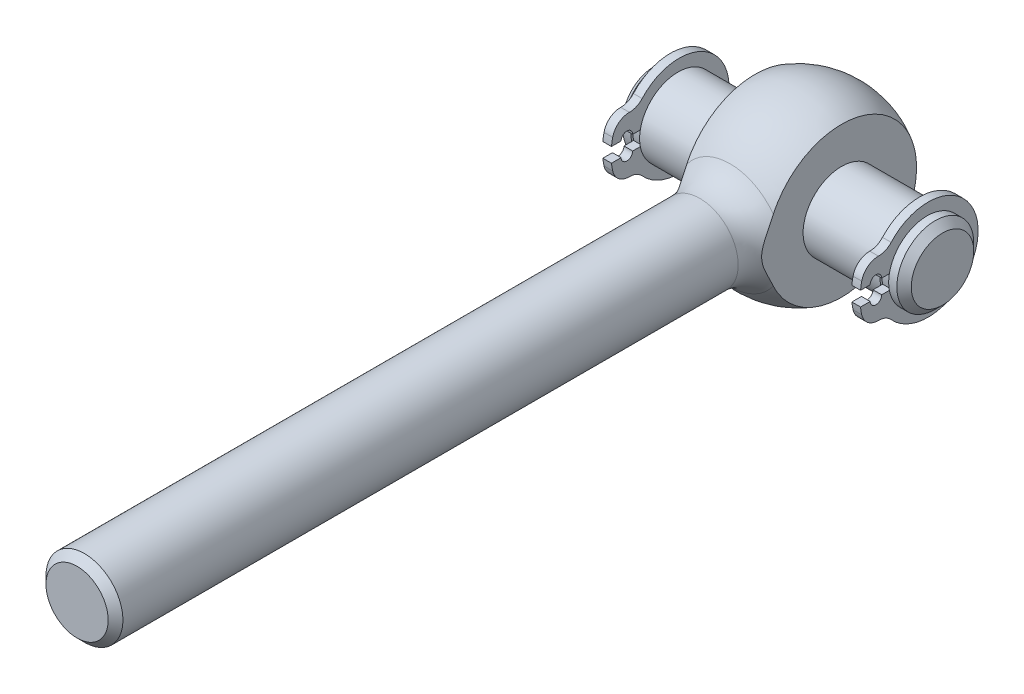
ISO-10303-21;
HEADER;
FILE_DESCRIPTION(('STEP AP214'),'2;1');
FILE_NAME('part.step','',(''),(''),'','','');
FILE_SCHEMA(('AUTOMOTIVE_DESIGN { 1 0 10303 214 1 1 1 1 }'));
ENDSEC;
DATA;
#1=APPLICATION_CONTEXT('core data for automotive mechanical design processes');
#2=APPLICATION_PROTOCOL_DEFINITION('international standard','automotive_design',2000,#1);
#3=PRODUCT_CONTEXT('',#1,'mechanical');
#4=PRODUCT('Part','Part','',(#3));
#5=PRODUCT_RELATED_PRODUCT_CATEGORY('part','',(#4));
#6=PRODUCT_DEFINITION_FORMATION('','',#4);
#7=PRODUCT_DEFINITION_CONTEXT('part definition',#1,'design');
#8=PRODUCT_DEFINITION('design','',#6,#7);
#9=PRODUCT_DEFINITION_SHAPE('','',#8);
#10=(LENGTH_UNIT() NAMED_UNIT(*) SI_UNIT(.MILLI.,.METRE.));
#11=(NAMED_UNIT(*) PLANE_ANGLE_UNIT() SI_UNIT($,.RADIAN.));
#12=(NAMED_UNIT(*) SI_UNIT($,.STERADIAN.) SOLID_ANGLE_UNIT());
#13=UNCERTAINTY_MEASURE_WITH_UNIT(LENGTH_MEASURE(1.E-05),#10,'distance_accuracy_value','');
#14=(GEOMETRIC_REPRESENTATION_CONTEXT(3) GLOBAL_UNCERTAINTY_ASSIGNED_CONTEXT((#13)) GLOBAL_UNIT_ASSIGNED_CONTEXT((#10,
#11,#12)) REPRESENTATION_CONTEXT('',''));
#15=CARTESIAN_POINT('',(0.,0.,0.));
#16=DIRECTION('',(0.,0.,1.));
#17=DIRECTION('',(1.,0.,0.));
#18=AXIS2_PLACEMENT_3D('',#15,#16,#17);
#19=CARTESIAN_POINT('',(0.,3.233,75.));
#20=DIRECTION('',(0.,0.,1.));
#21=DIRECTION('',(1.,0.,0.));
#22=AXIS2_PLACEMENT_3D('',#19,#20,#21);
#23=PLANE('',#22);
#24=CARTESIAN_POINT('',(0.,0.,75.));
#25=DIRECTION('',(0.,0.,-1.));
#26=DIRECTION('',(-1.,0.,0.));
#27=AXIS2_PLACEMENT_3D('',#24,#25,#26);
#28=CIRCLE('',#27,3.233);
#29=CARTESIAN_POINT('',(-3.233,0.,75.));
#30=VERTEX_POINT('',#29);
#31=EDGE_CURVE('E275',#30,#30,#28,.T.);
#32=ORIENTED_EDGE('',*,*,#31,.F.);
#33=EDGE_LOOP('',(#32));
#34=FACE_BOUND('',#33,.T.);
#35=ADVANCED_FACE('F14',(#34),#23,.T.);
#36=CARTESIAN_POINT('',(0.,0.,74.233));
#37=DIRECTION('',(0.,0.,-1.));
#38=DIRECTION('',(-1.,0.,0.));
#39=AXIS2_PLACEMENT_3D('',#36,#37,#38);
#40=CONICAL_SURFACE('',#39,4.,0.785398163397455);
#41=ORIENTED_EDGE('',*,*,#31,.T.);
#42=EDGE_LOOP('',(#41));
#43=FACE_BOUND('',#42,.T.);
#44=CARTESIAN_POINT('',(0.,0.,74.233));
#45=DIRECTION('',(0.,0.,-1.));
#46=DIRECTION('',(-1.,0.,0.));
#47=AXIS2_PLACEMENT_3D('',#44,#45,#46);
#48=CIRCLE('',#47,4.);
#49=CARTESIAN_POINT('',(-4.,0.,74.233));
#50=VERTEX_POINT('',#49);
#51=EDGE_CURVE('E323',#50,#50,#48,.T.);
#52=ORIENTED_EDGE('',*,*,#51,.F.);
#53=EDGE_LOOP('',(#52));
#54=FACE_BOUND('',#53,.T.);
#55=ADVANCED_FACE('F308',(#43,#54),#40,.T.);
#56=CARTESIAN_POINT('',(0.,0.,50.));
#57=DIRECTION('',(0.,0.,-1.));
#58=DIRECTION('',(-1.,0.,0.));
#59=AXIS2_PLACEMENT_3D('',#56,#57,#58);
#60=CYLINDRICAL_SURFACE('',#59,4.);
#61=ORIENTED_EDGE('',*,*,#51,.T.);
#62=EDGE_LOOP('',(#61));
#63=FACE_BOUND('',#62,.T.);
#64=CARTESIAN_POINT('',(0.,0.,10.24695076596));
#65=DIRECTION('',(0.,0.,-1.));
#66=DIRECTION('',(-1.,0.,0.));
#67=AXIS2_PLACEMENT_3D('',#64,#65,#66);
#68=CIRCLE('',#67,4.);
#69=CARTESIAN_POINT('',(-4.,0.,10.24695076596));
#70=VERTEX_POINT('',#69);
#71=EDGE_CURVE('E283',#70,#70,#68,.T.);
#72=ORIENTED_EDGE('',*,*,#71,.F.);
#73=EDGE_LOOP('',(#72));
#74=FACE_BOUND('',#73,.T.);
#75=ADVANCED_FACE('F311',(#63,#74),#60,.T.);
#76=CARTESIAN_POINT('',(0.,0.,10.2469507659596));
#77=DIRECTION('',(0.,0.,-1.));
#78=DIRECTION('',(-1.,0.,0.));
#79=AXIS2_PLACEMENT_3D('',#76,#77,#78);
#80=TOROIDAL_SURFACE('',#79,8.00000000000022,4.00000000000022);
#81=CARTESIAN_POINT('',(-4.5,0.,8.31045909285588));
#82=CARTESIAN_POINT('',(-4.5,0.0520725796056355,8.31046178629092));
#83=CARTESIAN_POINT('',(-4.5,0.104137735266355,8.30882003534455));
#84=CARTESIAN_POINT('',(-4.5,0.208080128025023,8.302329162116));
#85=CARTESIAN_POINT('',(-4.5,0.259957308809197,8.29747914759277));
#86=CARTESIAN_POINT('',(-4.5,0.41546427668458,8.27830149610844));
#87=CARTESIAN_POINT('',(-4.5,0.518539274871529,8.25934840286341));
#88=CARTESIAN_POINT('',(-4.5,0.72506243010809,8.21089052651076));
#89=CARTESIAN_POINT('',(-4.5,0.828442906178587,8.18110991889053));
#90=CARTESIAN_POINT('',(-4.5,0.981544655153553,8.13082580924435));
#91=CARTESIAN_POINT('',(-4.5,1.03222580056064,8.11313905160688));
#92=CARTESIAN_POINT('',(-4.5,1.13301101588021,8.07620861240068));
#93=CARTESIAN_POINT('',(-4.5,1.18311516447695,8.05696514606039));
#94=CARTESIAN_POINT('',(-4.5,1.32966876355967,7.99853924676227));
#95=CARTESIAN_POINT('',(-4.5,1.42542029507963,7.95761448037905));
#96=CARTESIAN_POINT('',(-4.5,1.61559055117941,7.87276280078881));
#97=CARTESIAN_POINT('',(-4.5,1.71000888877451,7.82883503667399));
#98=CARTESIAN_POINT('',(-4.5,1.89812253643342,7.73925564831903));
#99=CARTESIAN_POINT('',(-4.5,1.99181711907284,7.69360250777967));
#100=CARTESIAN_POINT('',(-4.5,2.17886928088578,7.60160856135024));
#101=CARTESIAN_POINT('',(-4.5,2.27222684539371,7.55526772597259));
#102=CARTESIAN_POINT('',(-4.5,2.55294481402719,7.41616784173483));
#103=CARTESIAN_POINT('',(-4.5,2.74040597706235,7.32360312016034));
#104=CARTESIAN_POINT('',(-4.5,3.11780075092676,7.14384112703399));
#105=CARTESIAN_POINT('',(-4.5,3.30773290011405,7.05664084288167));
#106=CARTESIAN_POINT('',(-4.5,3.68750731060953,6.89285363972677));
#107=CARTESIAN_POINT('',(-4.5,3.87726967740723,6.81608405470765));
#108=CARTESIAN_POINT('',(-4.5,4.26114234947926,6.67396293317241));
#109=CARTESIAN_POINT('',(-4.5,4.45525387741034,6.6086146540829));
#110=CARTESIAN_POINT('',(-4.5,4.84720493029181,6.49217026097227));
#111=CARTESIAN_POINT('',(-4.5,5.04503336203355,6.44103727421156));
#112=CARTESIAN_POINT('',(-4.5,5.44418226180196,6.35529794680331));
#113=CARTESIAN_POINT('',(-4.5,5.64550032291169,6.32068065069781));
#114=CARTESIAN_POINT('',(-4.5,6.00024488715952,6.2764907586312));
#115=CARTESIAN_POINT('',(-4.5,6.15316561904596,6.26283602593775));
#116=CARTESIAN_POINT('',(-4.5,6.4596196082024,6.24704635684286));
#117=CARTESIAN_POINT('',(-4.5,6.61315282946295,6.24491075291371));
#118=CARTESIAN_POINT('',(-4.5,6.92115450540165,6.2530092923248));
#119=CARTESIAN_POINT('',(-4.5,7.07562047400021,6.26334367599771));
#120=CARTESIAN_POINT('',(-4.5,7.38314125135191,6.29727424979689));
#121=CARTESIAN_POINT('',(-4.5,7.5361958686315,6.32087221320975));
#122=CARTESIAN_POINT('',(-4.5,7.81578471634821,6.37711482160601));
#123=CARTESIAN_POINT('',(-4.5,7.94272131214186,6.40776613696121));
#124=CARTESIAN_POINT('',(-4.5,8.1937256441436,6.47913669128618));
#125=CARTESIAN_POINT('',(-4.5,8.31779386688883,6.5198542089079));
#126=CARTESIAN_POINT('',(-4.5,8.56180897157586,6.6113729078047));
#127=CARTESIAN_POINT('',(-4.5,8.68176542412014,6.6621484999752));
#128=CARTESIAN_POINT('',(-4.5,8.91680993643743,6.7738236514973));
#129=CARTESIAN_POINT('',(-4.5,9.0319003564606,6.8347182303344));
#130=CARTESIAN_POINT('',(-4.5,9.25703619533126,6.96699897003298));
#131=CARTESIAN_POINT('',(-4.5,9.36703846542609,7.03845874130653));
#132=CARTESIAN_POINT('',(-4.5,9.57992679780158,7.19120860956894));
#133=CARTESIAN_POINT('',(-4.5,9.68281619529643,7.27249404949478));
#134=CARTESIAN_POINT('',(-4.5,9.88049649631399,7.44453446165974));
#135=CARTESIAN_POINT('',(-4.5,9.97528123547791,7.53529652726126));
#136=CARTESIAN_POINT('',(-4.5,10.1555657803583,7.72561432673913));
#137=CARTESIAN_POINT('',(-4.5,10.2410667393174,7.82516896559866));
#138=CARTESIAN_POINT('',(-4.5,10.393057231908,8.02107497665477));
#139=CARTESIAN_POINT('',(-4.5,10.4606027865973,8.11660867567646));
#140=CARTESIAN_POINT('',(-4.5,10.5868071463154,8.31337253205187));
#141=CARTESIAN_POINT('',(-4.5,10.6454668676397,8.41460210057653));
#142=CARTESIAN_POINT('',(-4.5,10.7532573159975,8.62193687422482));
#143=CARTESIAN_POINT('',(-4.5,10.8023938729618,8.7280390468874));
#144=CARTESIAN_POINT('',(-4.5,10.890653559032,8.94433034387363));
#145=CARTESIAN_POINT('',(-4.5,10.9297771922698,9.05451926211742));
#146=CARTESIAN_POINT('',(-4.5,10.9950429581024,9.26969078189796));
#147=CARTESIAN_POINT('',(-4.5,11.0219375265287,9.37444580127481));
#148=CARTESIAN_POINT('',(-4.5,11.0665420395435,9.58593564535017));
#149=CARTESIAN_POINT('',(-4.5,11.0842487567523,9.69267115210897));
#150=CARTESIAN_POINT('',(-4.5,11.110282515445,9.90722076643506));
#151=CARTESIAN_POINT('',(-4.5,11.1186147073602,10.0150342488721));
#152=CARTESIAN_POINT('',(-4.5,11.125838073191,10.2310158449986));
#153=CARTESIAN_POINT('',(-4.5,11.1247258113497,10.3391840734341));
#154=CARTESIAN_POINT('',(-4.5,11.1132468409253,10.5515447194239));
#155=CARTESIAN_POINT('',(-4.5,11.1031787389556,10.6557531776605));
#156=CARTESIAN_POINT('',(-4.5,11.0743003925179,10.8629622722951));
#157=CARTESIAN_POINT('',(-4.5,11.0554870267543,10.9659624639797));
#158=CARTESIAN_POINT('',(-4.5,10.9861538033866,11.2719591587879));
#159=CARTESIAN_POINT('',(-4.5,10.9227277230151,11.4721874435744));
#160=CARTESIAN_POINT('',(-4.5,10.7634593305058,11.8600012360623));
#161=CARTESIAN_POINT('',(-4.5,10.6674996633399,12.0475379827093));
#162=CARTESIAN_POINT('',(-4.5,10.4465009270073,12.404603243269));
#163=CARTESIAN_POINT('',(-4.5,10.3214590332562,12.5741300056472));
#164=CARTESIAN_POINT('',(-4.5,10.0413054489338,12.8971808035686));
#165=CARTESIAN_POINT('',(-4.5,9.88526420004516,13.0498967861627));
#166=CARTESIAN_POINT('',(-4.5,9.55124453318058,13.3290152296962));
#167=CARTESIAN_POINT('',(-4.5,9.37326025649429,13.4554106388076));
#168=CARTESIAN_POINT('',(-4.5,8.98720936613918,13.688191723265));
#169=CARTESIAN_POINT('',(-4.5,8.77790385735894,13.7925174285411));
#170=CARTESIAN_POINT('',(-4.5,8.34608313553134,13.9684774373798));
#171=CARTESIAN_POINT('',(-4.5,8.12356537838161,14.0401054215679));
#172=CARTESIAN_POINT('',(-4.5,7.64526829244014,14.1577129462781));
#173=CARTESIAN_POINT('',(-4.5,7.38856367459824,14.1998995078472));
#174=CARTESIAN_POINT('',(-4.5,6.87168522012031,14.2473372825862));
#175=CARTESIAN_POINT('',(-4.5,6.61150820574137,14.2525519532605));
#176=CARTESIAN_POINT('',(-4.5,6.15183667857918,14.2323371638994));
#177=CARTESIAN_POINT('',(-4.5,5.95199288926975,14.2136045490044));
#178=CARTESIAN_POINT('',(-4.5,5.55471845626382,14.1583271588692));
#179=CARTESIAN_POINT('',(-4.5,5.35728900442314,14.1217739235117));
#180=CARTESIAN_POINT('',(-4.5,4.96604892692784,14.0330708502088));
#181=CARTESIAN_POINT('',(-4.5,4.77223795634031,13.9809225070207));
#182=CARTESIAN_POINT('',(-4.5,4.38875742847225,13.8634025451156));
#183=CARTESIAN_POINT('',(-4.5,4.19908718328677,13.7980331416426));
#184=CARTESIAN_POINT('',(-4.5,3.79709387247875,13.6464957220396));
#185=CARTESIAN_POINT('',(-4.5,3.58539470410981,13.5586912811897));
#186=CARTESIAN_POINT('',(-4.5,3.16637618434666,13.3731908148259));
#187=CARTESIAN_POINT('',(-4.5,2.95905842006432,13.2754912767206));
#188=CARTESIAN_POINT('',(-4.5,2.64946398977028,13.1251872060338));
#189=CARTESIAN_POINT('',(-4.5,2.54630425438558,13.0743612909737));
#190=CARTESIAN_POINT('',(-4.5,2.3401646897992,12.9723446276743));
#191=CARTESIAN_POINT('',(-4.5,2.23718485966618,12.9211538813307));
#192=CARTESIAN_POINT('',(-4.5,2.03095292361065,12.8194359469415));
#193=CARTESIAN_POINT('',(-4.5,1.92770095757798,12.7689084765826));
#194=CARTESIAN_POINT('',(-4.5,1.72026477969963,12.6698040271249));
#195=CARTESIAN_POINT('',(-4.5,1.61608066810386,12.6212268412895));
#196=CARTESIAN_POINT('',(-4.5,1.42355027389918,12.5355726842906));
#197=CARTESIAN_POINT('',(-4.5,1.33545916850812,12.4979285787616));
#198=CARTESIAN_POINT('',(-4.5,1.15765365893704,12.4265649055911));
#199=CARTESIAN_POINT('',(-4.5,1.06793890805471,12.392846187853));
#200=CARTESIAN_POINT('',(-4.5,0.887189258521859,12.3312727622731));
#201=CARTESIAN_POINT('',(-4.5,0.796168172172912,12.3033782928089));
#202=CARTESIAN_POINT('',(-4.5,0.612153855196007,12.2551631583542));
#203=CARTESIAN_POINT('',(-4.5,0.519162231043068,12.2348365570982));
#204=CARTESIAN_POINT('',(-4.5,0.349769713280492,12.206710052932));
#205=CARTESIAN_POINT('',(-4.5,0.273648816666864,12.1972452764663));
#206=CARTESIAN_POINT('',(-4.5,0.120850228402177,12.1852179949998));
#207=CARTESIAN_POINT('',(-4.5,0.0441725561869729,12.1826552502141));
#208=CARTESIAN_POINT('',(-4.5,-0.109167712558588,12.1846537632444));
#209=CARTESIAN_POINT('',(-4.5,-0.185830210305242,12.1892224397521));
#210=CARTESIAN_POINT('',(-4.5,-0.338388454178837,12.2051051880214));
#211=CARTESIAN_POINT('',(-4.5,-0.414284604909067,12.2164154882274));
#212=CARTESIAN_POINT('',(-4.5,-0.605880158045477,12.2527058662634));
#213=CARTESIAN_POINT('',(-4.5,-0.720799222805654,12.281774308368));
#214=CARTESIAN_POINT('',(-4.5,-0.947605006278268,12.3501462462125));
#215=CARTESIAN_POINT('',(-4.5,-1.0594864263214,12.3894664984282));
#216=CARTESIAN_POINT('',(-4.5,-1.28129663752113,12.4750489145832));
#217=CARTESIAN_POINT('',(-4.5,-1.39120907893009,12.5213524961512));
#218=CARTESIAN_POINT('',(-4.5,-1.6091403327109,12.6179870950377));
#219=CARTESIAN_POINT('',(-4.5,-1.71716016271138,12.6683158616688));
#220=CARTESIAN_POINT('',(-4.5,-1.93435668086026,12.7720933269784));
#221=CARTESIAN_POINT('',(-4.5,-2.04351285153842,12.8255844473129));
#222=CARTESIAN_POINT('',(-4.5,-2.26151195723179,12.933207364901));
#223=CARTESIAN_POINT('',(-4.5,-2.37035487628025,12.9873391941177));
#224=CARTESIAN_POINT('',(-4.5,-2.58793470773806,13.0948890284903));
#225=CARTESIAN_POINT('',(-4.5,-2.69667071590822,13.1483088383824));
#226=CARTESIAN_POINT('',(-4.5,-2.91484212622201,13.2536972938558));
#227=CARTESIAN_POINT('',(-4.5,-3.02427752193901,13.3056659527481));
#228=CARTESIAN_POINT('',(-4.5,-3.35007402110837,13.4563162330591));
#229=CARTESIAN_POINT('',(-4.5,-3.56794714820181,13.5518035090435));
#230=CARTESIAN_POINT('',(-4.5,-4.00948637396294,13.7292619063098));
#231=CARTESIAN_POINT('',(-4.5,-4.23315806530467,13.8112193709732));
#232=CARTESIAN_POINT('',(-4.5,-4.68453165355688,13.9566168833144));
#233=CARTESIAN_POINT('',(-4.5,-4.91218622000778,14.0202015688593));
#234=CARTESIAN_POINT('',(-4.5,-5.37240029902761,14.1258037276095));
#235=CARTESIAN_POINT('',(-4.5,-5.60495564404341,14.1678388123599));
#236=CARTESIAN_POINT('',(-4.5,-5.98608678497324,14.2158454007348));
#237=CARTESIAN_POINT('',(-4.5,-6.1337239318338,14.2294154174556));
#238=CARTESIAN_POINT('',(-4.5,-6.42957916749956,14.2458552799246));
#239=CARTESIAN_POINT('',(-4.5,-6.57779707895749,14.2487281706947));
#240=CARTESIAN_POINT('',(-4.5,-6.87418460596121,14.2430328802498));
#241=CARTESIAN_POINT('',(-4.5,-7.02235400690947,14.2344526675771));
#242=CARTESIAN_POINT('',(-4.5,-7.31744517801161,14.2051916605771));
#243=CARTESIAN_POINT('',(-4.5,-7.46436747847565,14.1845163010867));
#244=CARTESIAN_POINT('',(-4.5,-7.75717683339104,14.1303093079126));
#245=CARTESIAN_POINT('',(-4.5,-7.90304346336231,14.0966663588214));
#246=CARTESIAN_POINT('',(-4.5,-8.19103207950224,14.0161784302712));
#247=CARTESIAN_POINT('',(-4.5,-8.33315585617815,13.9693398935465));
#248=CARTESIAN_POINT('',(-4.5,-8.61228221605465,13.862264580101));
#249=CARTESIAN_POINT('',(-4.5,-8.74928482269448,13.8020278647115));
#250=CARTESIAN_POINT('',(-4.5,-9.01660103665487,13.6681868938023));
#251=CARTESIAN_POINT('',(-4.5,-9.14691568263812,13.5945847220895));
#252=CARTESIAN_POINT('',(-4.5,-9.38504218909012,13.443309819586));
#253=CARTESIAN_POINT('',(-4.5,-9.49373686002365,13.3670249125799));
#254=CARTESIAN_POINT('',(-4.5,-9.70341967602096,13.2045176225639));
#255=CARTESIAN_POINT('',(-4.5,-9.80440900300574,13.1182967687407));
#256=CARTESIAN_POINT('',(-4.5,-9.99747606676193,12.9365140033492));
#257=CARTESIAN_POINT('',(-4.5,-10.0895599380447,12.8409586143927));
#258=CARTESIAN_POINT('',(-4.5,-10.2637799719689,12.6411735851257));
#259=CARTESIAN_POINT('',(-4.5,-10.3459174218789,12.5369450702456));
#260=CARTESIAN_POINT('',(-4.5,-10.4894546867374,12.3344652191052));
#261=CARTESIAN_POINT('',(-4.5,-10.552163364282,12.2371391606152));
#262=CARTESIAN_POINT('',(-4.5,-10.6685847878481,12.0372518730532));
#263=CARTESIAN_POINT('',(-4.5,-10.7222985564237,11.9346912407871));
#264=CARTESIAN_POINT('',(-4.5,-10.8201578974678,11.7251474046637));
#265=CARTESIAN_POINT('',(-4.5,-10.86430703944,11.6181658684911));
#266=CARTESIAN_POINT('',(-4.5,-10.9425918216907,11.400598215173));
#267=CARTESIAN_POINT('',(-4.5,-10.9767278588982,11.2900122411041));
#268=CARTESIAN_POINT('',(-4.5,-11.032566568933,11.0740838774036));
#269=CARTESIAN_POINT('',(-4.5,-11.0549781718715,10.968924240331));
#270=CARTESIAN_POINT('',(-4.5,-11.0906307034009,10.7570203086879));
#271=CARTESIAN_POINT('',(-4.5,-11.1038684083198,10.6502754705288));
#272=CARTESIAN_POINT('',(-4.5,-11.1210264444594,10.43610208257));
#273=CARTESIAN_POINT('',(-4.5,-11.1249522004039,10.3286739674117));
#274=CARTESIAN_POINT('',(-4.5,-11.1234652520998,10.1138439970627));
#275=CARTESIAN_POINT('',(-4.5,-11.1180491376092,10.0064421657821));
#276=CARTESIAN_POINT('',(-4.5,-11.0981996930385,9.79547731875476));
#277=CARTESIAN_POINT('',(-4.5,-11.0840206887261,9.69189046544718));
#278=CARTESIAN_POINT('',(-4.5,-11.0470136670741,9.48626261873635));
#279=CARTESIAN_POINT('',(-4.5,-11.0241825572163,9.38422219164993));
#280=CARTESIAN_POINT('',(-4.5,-10.9429911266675,9.08158211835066));
#281=CARTESIAN_POINT('',(-4.5,-10.8719112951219,8.88424011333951));
#282=CARTESIAN_POINT('',(-4.5,-10.6977341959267,8.50259452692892));
#283=CARTESIAN_POINT('',(-4.5,-10.5943998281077,8.31840033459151));
#284=CARTESIAN_POINT('',(-4.5,-10.3594009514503,7.96909627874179));
#285=CARTESIAN_POINT('',(-4.5,-10.2277346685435,7.80398761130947));
#286=CARTESIAN_POINT('',(-4.5,-9.93446300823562,7.49020016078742));
#287=CARTESIAN_POINT('',(-4.5,-9.77186533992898,7.3424510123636));
#288=CARTESIAN_POINT('',(-4.5,-9.42565994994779,7.07409531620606));
#289=CARTESIAN_POINT('',(-4.5,-9.2420445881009,6.95349868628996));
#290=CARTESIAN_POINT('',(-4.5,-8.8445684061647,6.73287452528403));
#291=CARTESIAN_POINT('',(-4.5,-8.62947114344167,6.63508076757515));
#292=CARTESIAN_POINT('',(-4.5,-8.18715391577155,6.4727852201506));
#293=CARTESIAN_POINT('',(-4.5,-7.9599304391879,6.40829313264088));
#294=CARTESIAN_POINT('',(-4.5,-7.4712856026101,6.30575462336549));
#295=CARTESIAN_POINT('',(-4.5,-7.20901776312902,6.27177974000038));
#296=CARTESIAN_POINT('',(-4.5,-6.68272716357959,6.2412133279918));
#297=CARTESIAN_POINT('',(-4.5,-6.41870606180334,6.24459043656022));
#298=CARTESIAN_POINT('',(-4.5,-5.94860779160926,6.28027556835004));
#299=CARTESIAN_POINT('',(-4.5,-5.74200794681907,6.30635789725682));
#300=CARTESIAN_POINT('',(-4.5,-5.33174939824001,6.37687668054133));
#301=CARTESIAN_POINT('',(-4.5,-5.12809453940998,6.42133521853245));
#302=CARTESIAN_POINT('',(-4.5,-4.72176533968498,6.52689284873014));
#303=CARTESIAN_POINT('',(-4.5,-4.51915776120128,6.58824464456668));
#304=CARTESIAN_POINT('',(-4.5,-4.1191331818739,6.72423602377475));
#305=CARTESIAN_POINT('',(-4.5,-3.92170352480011,6.79883888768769));
#306=CARTESIAN_POINT('',(-4.5,-3.56705494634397,6.94371121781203));
#307=CARTESIAN_POINT('',(-4.5,-3.40911905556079,7.01225396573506));
#308=CARTESIAN_POINT('',(-4.5,-3.09552315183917,7.15438290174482));
#309=CARTESIAN_POINT('',(-4.5,-2.9398635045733,7.22796988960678));
#310=CARTESIAN_POINT('',(-4.5,-2.62821772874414,7.37882929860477));
#311=CARTESIAN_POINT('',(-4.5,-2.47224725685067,7.45613362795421));
#312=CARTESIAN_POINT('',(-4.5,-2.16032372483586,7.61075202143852));
#313=CARTESIAN_POINT('',(-4.5,-2.0043706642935,7.68806608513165));
#314=CARTESIAN_POINT('',(-4.5,-1.69990609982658,7.83406468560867));
#315=CARTESIAN_POINT('',(-4.5,-1.55151334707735,7.90298843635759));
#316=CARTESIAN_POINT('',(-4.5,-1.3258906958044,7.99968059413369));
#317=CARTESIAN_POINT('',(-4.5,-1.25012969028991,8.03081294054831));
#318=CARTESIAN_POINT('',(-4.5,-1.09737801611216,8.08987726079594));
#319=CARTESIAN_POINT('',(-4.5,-1.02038718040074,8.11780879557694));
#320=CARTESIAN_POINT('',(-4.5,-0.790237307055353,8.19410989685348));
#321=CARTESIAN_POINT('',(-4.5,-0.634839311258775,8.23639174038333));
#322=CARTESIAN_POINT('',(-4.5,-0.398361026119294,8.28011958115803));
#323=CARTESIAN_POINT('',(-4.5,-0.319098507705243,8.29141067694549));
#324=CARTESIAN_POINT('',(-4.5,-0.159884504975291,8.30657593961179));
#325=CARTESIAN_POINT('',(-4.5,-0.0799335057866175,8.31045495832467));
#326=CARTESIAN_POINT('',(-4.5,0.,8.31045909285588));
#327=B_SPLINE_CURVE_WITH_KNOTS('',3,(#81,#82,#83,#84,#85,#86,#87,#88,#89,#90,#91,#92,#93,#94,
#95,#96,#97,#98,#99,#100,#101,#102,#103,#104,#105,#106,#107,#108,#109,#110,#111,#112,#113,#114,
#115,#116,#117,#118,#119,#120,#121,#122,#123,#124,#125,#126,#127,#128,#129,#130,#131,#132,#133,
#134,#135,#136,#137,#138,#139,#140,#141,#142,#143,#144,#145,#146,#147,#148,#149,#150,#151,#152,
#153,#154,#155,#156,#157,#158,#159,#160,#161,#162,#163,#164,#165,#166,#167,#168,#169,#170,#171,
#172,#173,#174,#175,#176,#177,#178,#179,#180,#181,#182,#183,#184,#185,#186,#187,#188,#189,#190,
#191,#192,#193,#194,#195,#196,#197,#198,#199,#200,#201,#202,#203,#204,#205,#206,#207,#208,#209,
#210,#211,#212,#213,#214,#215,#216,#217,#218,#219,#220,#221,#222,#223,#224,#225,#226,#227,#228,
#229,#230,#231,#232,#233,#234,#235,#236,#237,#238,#239,#240,#241,#242,#243,#244,#245,#246,#247,
#248,#249,#250,#251,#252,#253,#254,#255,#256,#257,#258,#259,#260,#261,#262,#263,#264,#265,#266,
#267,#268,#269,#270,#271,#272,#273,#274,#275,#276,#277,#278,#279,#280,#281,#282,#283,#284,#285,
#286,#287,#288,#289,#290,#291,#292,#293,#294,#295,#296,#297,#298,#299,#300,#301,#302,#303,#304,
#305,#306,#307,#308,#309,#310,#311,#312,#313,#314,#315,#316,#317,#318,#319,#320,#321,#322,#323,
#324,#325,#326),.UNSPECIFIED.,.T.,.F.,(4,2,2,2,2,2,2,2,2,2,2,2,2,2,2,2,2,2,2,2,2,2,2,2,2,2,2,2,
2,2,2,2,2,2,2,2,2,2,2,2,2,2,2,2,2,2,2,2,2,2,2,2,2,2,2,2,2,2,2,2,2,2,2,2,2,2,2,2,2,2,2,2,2,2,2,2,
2,2,2,2,2,2,2,2,2,2,2,2,2,2,2,2,2,2,2,2,2,2,2,2,2,2,2,2,2,2,2,2,2,2,2,2,2,2,2,2,2,2,2,2,2,2,4),
(0.,0.156178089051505,0.312399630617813,0.626124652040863,0.948476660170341,1.10949327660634,
1.27048766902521,1.58278474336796,1.89517067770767,2.20783783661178,2.52051844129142,
3.14770534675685,3.77453675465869,4.38836285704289,5.0023637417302,5.61475679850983,
6.22674306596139,6.6869448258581,7.147119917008,7.61101891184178,8.07497994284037,
8.46634358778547,8.85764035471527,9.24795410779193,9.63807631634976,10.0310572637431,
10.4238526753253,10.8169442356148,11.2099869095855,11.5605290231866,11.9110349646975,
12.2613256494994,12.611598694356,12.9356556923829,13.259826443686,13.5838190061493,
13.9079294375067,14.2216222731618,14.5354271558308,15.162337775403,15.7915342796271,
16.420791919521,17.0729753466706,17.7253332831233,18.4240450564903,19.1228918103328,
19.9003753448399,20.6786272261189,21.2799590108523,21.8815765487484,22.483136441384,
23.0845956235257,23.7717710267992,24.4591912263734,24.8041964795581,25.1491999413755,
25.4940514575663,25.8388663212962,26.1261972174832,26.4135902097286,26.6989519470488,
26.9840893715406,27.213928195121,27.4437590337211,27.6738291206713,27.9037706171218,
28.2586544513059,28.6141220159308,28.9717873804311,29.3292541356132,29.6939204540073,
30.0586050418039,30.4220460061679,30.7854836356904,31.4988082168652,32.2128484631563,
32.9211039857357,33.6287797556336,34.073223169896,34.5175400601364,34.9623240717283,
35.4069083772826,35.8553972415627,36.3036675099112,36.7519357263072,37.2001341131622,
37.5979458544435,37.9956964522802,38.3931710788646,38.7905942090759,39.1374810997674,
39.4843285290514,39.8310462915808,40.1777503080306,40.4999186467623,40.8222001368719,
41.1442938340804,41.4665051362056,41.7797775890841,42.093162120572,42.7192658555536,
43.3500849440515,43.980943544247,44.6372121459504,45.2937200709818,45.9996821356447,
46.7058497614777,47.4962410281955,48.285968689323,48.909820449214,49.534424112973,
50.1689326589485,50.8017096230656,51.3181019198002,51.8345762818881,52.3568002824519,
52.8790057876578,53.3697031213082,53.6153562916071,53.8610431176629,54.3423413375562,
54.5822380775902,54.8219777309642),.UNSPECIFIED.);
#328=CARTESIAN_POINT('',(-4.5,-3.22870813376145,7.094042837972));
#329=VERTEX_POINT('',#328);
#330=CARTESIAN_POINT('',(-4.5,3.22870813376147,7.09404283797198));
#331=VERTEX_POINT('',#330);
#332=EDGE_CURVE('E9',#329,#331,#327,.T.);
#333=ORIENTED_EDGE('',*,*,#332,.F.);
#334=CARTESIAN_POINT('',(0.,0.,7.094042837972));
#335=DIRECTION('',(0.,0.,-1.));
#336=DIRECTION('',(-1.,0.,0.));
#337=AXIS2_PLACEMENT_3D('',#334,#335,#336);
#338=CIRCLE('',#337,5.5384615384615);
#339=CARTESIAN_POINT('',(4.5,-3.22870813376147,7.09404283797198));
#340=VERTEX_POINT('',#339);
#341=EDGE_CURVE('E270',#340,#329,#338,.T.);
#342=ORIENTED_EDGE('',*,*,#341,.F.);
#343=CARTESIAN_POINT('',(4.5,0.,8.31045909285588));
#344=CARTESIAN_POINT('',(4.5,-0.0520725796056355,8.31046178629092));
#345=CARTESIAN_POINT('',(4.5,-0.104137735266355,8.30882003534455));
#346=CARTESIAN_POINT('',(4.5,-0.208080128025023,8.302329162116));
#347=CARTESIAN_POINT('',(4.5,-0.259957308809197,8.29747914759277));
#348=CARTESIAN_POINT('',(4.5,-0.41546427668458,8.27830149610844));
#349=CARTESIAN_POINT('',(4.5,-0.518539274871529,8.25934840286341));
#350=CARTESIAN_POINT('',(4.5,-0.72506243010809,8.21089052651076));
#351=CARTESIAN_POINT('',(4.5,-0.828442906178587,8.18110991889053));
#352=CARTESIAN_POINT('',(4.5,-0.981544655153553,8.13082580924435));
#353=CARTESIAN_POINT('',(4.5,-1.03222580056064,8.11313905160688));
#354=CARTESIAN_POINT('',(4.5,-1.13301101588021,8.07620861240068));
#355=CARTESIAN_POINT('',(4.5,-1.18311516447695,8.05696514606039));
#356=CARTESIAN_POINT('',(4.5,-1.32966876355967,7.99853924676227));
#357=CARTESIAN_POINT('',(4.5,-1.42542029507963,7.95761448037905));
#358=CARTESIAN_POINT('',(4.5,-1.61559055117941,7.87276280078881));
#359=CARTESIAN_POINT('',(4.5,-1.71000888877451,7.82883503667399));
#360=CARTESIAN_POINT('',(4.5,-1.89812253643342,7.73925564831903));
#361=CARTESIAN_POINT('',(4.5,-1.99181711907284,7.69360250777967));
#362=CARTESIAN_POINT('',(4.5,-2.17886928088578,7.60160856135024));
#363=CARTESIAN_POINT('',(4.5,-2.27222684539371,7.55526772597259));
#364=CARTESIAN_POINT('',(4.5,-2.55294481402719,7.41616784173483));
#365=CARTESIAN_POINT('',(4.5,-2.74040597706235,7.32360312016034));
#366=CARTESIAN_POINT('',(4.5,-3.11780075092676,7.14384112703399));
#367=CARTESIAN_POINT('',(4.5,-3.30773290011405,7.05664084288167));
#368=CARTESIAN_POINT('',(4.5,-3.68750731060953,6.89285363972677));
#369=CARTESIAN_POINT('',(4.5,-3.87726967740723,6.81608405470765));
#370=CARTESIAN_POINT('',(4.5,-4.26114234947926,6.67396293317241));
#371=CARTESIAN_POINT('',(4.5,-4.45525387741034,6.6086146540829));
#372=CARTESIAN_POINT('',(4.5,-4.84720493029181,6.49217026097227));
#373=CARTESIAN_POINT('',(4.5,-5.04503336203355,6.44103727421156));
#374=CARTESIAN_POINT('',(4.5,-5.44418226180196,6.35529794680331));
#375=CARTESIAN_POINT('',(4.5,-5.64550032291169,6.32068065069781));
#376=CARTESIAN_POINT('',(4.5,-6.00024488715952,6.2764907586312));
#377=CARTESIAN_POINT('',(4.5,-6.15316561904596,6.26283602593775));
#378=CARTESIAN_POINT('',(4.5,-6.4596196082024,6.24704635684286));
#379=CARTESIAN_POINT('',(4.5,-6.61315282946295,6.24491075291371));
#380=CARTESIAN_POINT('',(4.5,-6.92115450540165,6.2530092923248));
#381=CARTESIAN_POINT('',(4.5,-7.07562047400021,6.26334367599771));
#382=CARTESIAN_POINT('',(4.5,-7.38314125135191,6.29727424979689));
#383=CARTESIAN_POINT('',(4.5,-7.5361958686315,6.32087221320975));
#384=CARTESIAN_POINT('',(4.5,-7.81578471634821,6.37711482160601));
#385=CARTESIAN_POINT('',(4.5,-7.94272131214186,6.40776613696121));
#386=CARTESIAN_POINT('',(4.5,-8.1937256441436,6.47913669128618));
#387=CARTESIAN_POINT('',(4.5,-8.31779386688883,6.5198542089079));
#388=CARTESIAN_POINT('',(4.5,-8.56180897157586,6.6113729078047));
#389=CARTESIAN_POINT('',(4.5,-8.68176542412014,6.6621484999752));
#390=CARTESIAN_POINT('',(4.5,-8.91680993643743,6.7738236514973));
#391=CARTESIAN_POINT('',(4.5,-9.0319003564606,6.8347182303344));
#392=CARTESIAN_POINT('',(4.5,-9.25703619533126,6.96699897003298));
#393=CARTESIAN_POINT('',(4.5,-9.36703846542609,7.03845874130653));
#394=CARTESIAN_POINT('',(4.5,-9.57992679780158,7.19120860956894));
#395=CARTESIAN_POINT('',(4.5,-9.68281619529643,7.27249404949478));
#396=CARTESIAN_POINT('',(4.5,-9.88049649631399,7.44453446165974));
#397=CARTESIAN_POINT('',(4.5,-9.97528123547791,7.53529652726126));
#398=CARTESIAN_POINT('',(4.5,-10.1555657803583,7.72561432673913));
#399=CARTESIAN_POINT('',(4.5,-10.2410667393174,7.82516896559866));
#400=CARTESIAN_POINT('',(4.5,-10.393057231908,8.02107497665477));
#401=CARTESIAN_POINT('',(4.5,-10.4606027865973,8.11660867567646));
#402=CARTESIAN_POINT('',(4.5,-10.5868071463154,8.31337253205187));
#403=CARTESIAN_POINT('',(4.5,-10.6454668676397,8.41460210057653));
#404=CARTESIAN_POINT('',(4.5,-10.7532573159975,8.62193687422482));
#405=CARTESIAN_POINT('',(4.5,-10.8023938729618,8.7280390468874));
#406=CARTESIAN_POINT('',(4.5,-10.890653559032,8.94433034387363));
#407=CARTESIAN_POINT('',(4.5,-10.9297771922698,9.05451926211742));
#408=CARTESIAN_POINT('',(4.5,-10.9950429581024,9.26969078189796));
#409=CARTESIAN_POINT('',(4.5,-11.0219375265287,9.37444580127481));
#410=CARTESIAN_POINT('',(4.5,-11.0665420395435,9.58593564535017));
#411=CARTESIAN_POINT('',(4.5,-11.0842487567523,9.69267115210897));
#412=CARTESIAN_POINT('',(4.5,-11.110282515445,9.90722076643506));
#413=CARTESIAN_POINT('',(4.5,-11.1186147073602,10.0150342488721));
#414=CARTESIAN_POINT('',(4.5,-11.125838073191,10.2310158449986));
#415=CARTESIAN_POINT('',(4.5,-11.1247258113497,10.3391840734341));
#416=CARTESIAN_POINT('',(4.5,-11.1132468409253,10.5515447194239));
#417=CARTESIAN_POINT('',(4.5,-11.1031787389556,10.6557531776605));
#418=CARTESIAN_POINT('',(4.5,-11.0743003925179,10.8629622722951));
#419=CARTESIAN_POINT('',(4.5,-11.0554870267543,10.9659624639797));
#420=CARTESIAN_POINT('',(4.5,-10.9861538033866,11.2719591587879));
#421=CARTESIAN_POINT('',(4.5,-10.9227277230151,11.4721874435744));
#422=CARTESIAN_POINT('',(4.5,-10.7634593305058,11.8600012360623));
#423=CARTESIAN_POINT('',(4.5,-10.6674996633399,12.0475379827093));
#424=CARTESIAN_POINT('',(4.5,-10.4465009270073,12.404603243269));
#425=CARTESIAN_POINT('',(4.5,-10.3214590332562,12.5741300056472));
#426=CARTESIAN_POINT('',(4.5,-10.0413054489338,12.8971808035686));
#427=CARTESIAN_POINT('',(4.5,-9.88526420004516,13.0498967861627));
#428=CARTESIAN_POINT('',(4.5,-9.55124453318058,13.3290152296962));
#429=CARTESIAN_POINT('',(4.5,-9.37326025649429,13.4554106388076));
#430=CARTESIAN_POINT('',(4.5,-8.98720936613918,13.688191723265));
#431=CARTESIAN_POINT('',(4.5,-8.77790385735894,13.7925174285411));
#432=CARTESIAN_POINT('',(4.5,-8.34608313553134,13.9684774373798));
#433=CARTESIAN_POINT('',(4.5,-8.12356537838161,14.0401054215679));
#434=CARTESIAN_POINT('',(4.5,-7.64526829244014,14.1577129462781));
#435=CARTESIAN_POINT('',(4.5,-7.38856367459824,14.1998995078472));
#436=CARTESIAN_POINT('',(4.5,-6.87168522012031,14.2473372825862));
#437=CARTESIAN_POINT('',(4.5,-6.61150820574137,14.2525519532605));
#438=CARTESIAN_POINT('',(4.5,-6.15183667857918,14.2323371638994));
#439=CARTESIAN_POINT('',(4.5,-5.95199288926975,14.2136045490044));
#440=CARTESIAN_POINT('',(4.5,-5.55471845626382,14.1583271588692));
#441=CARTESIAN_POINT('',(4.5,-5.35728900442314,14.1217739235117));
#442=CARTESIAN_POINT('',(4.5,-4.96604892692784,14.0330708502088));
#443=CARTESIAN_POINT('',(4.5,-4.77223795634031,13.9809225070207));
#444=CARTESIAN_POINT('',(4.5,-4.38875742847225,13.8634025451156));
#445=CARTESIAN_POINT('',(4.5,-4.19908718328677,13.7980331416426));
#446=CARTESIAN_POINT('',(4.5,-3.79709387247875,13.6464957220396));
#447=CARTESIAN_POINT('',(4.5,-3.58539470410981,13.5586912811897));
#448=CARTESIAN_POINT('',(4.5,-3.16637618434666,13.3731908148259));
#449=CARTESIAN_POINT('',(4.5,-2.95905842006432,13.2754912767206));
#450=CARTESIAN_POINT('',(4.5,-2.64946398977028,13.1251872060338));
#451=CARTESIAN_POINT('',(4.5,-2.54630425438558,13.0743612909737));
#452=CARTESIAN_POINT('',(4.5,-2.3401646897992,12.9723446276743));
#453=CARTESIAN_POINT('',(4.5,-2.23718485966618,12.9211538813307));
#454=CARTESIAN_POINT('',(4.5,-2.03095292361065,12.8194359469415));
#455=CARTESIAN_POINT('',(4.5,-1.92770095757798,12.7689084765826));
#456=CARTESIAN_POINT('',(4.5,-1.72026477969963,12.6698040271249));
#457=CARTESIAN_POINT('',(4.5,-1.61608066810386,12.6212268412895));
#458=CARTESIAN_POINT('',(4.5,-1.42355027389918,12.5355726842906));
#459=CARTESIAN_POINT('',(4.5,-1.33545916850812,12.4979285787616));
#460=CARTESIAN_POINT('',(4.5,-1.15765365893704,12.4265649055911));
#461=CARTESIAN_POINT('',(4.5,-1.06793890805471,12.392846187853));
#462=CARTESIAN_POINT('',(4.5,-0.887189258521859,12.3312727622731));
#463=CARTESIAN_POINT('',(4.5,-0.796168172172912,12.3033782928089));
#464=CARTESIAN_POINT('',(4.5,-0.612153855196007,12.2551631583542));
#465=CARTESIAN_POINT('',(4.5,-0.519162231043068,12.2348365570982));
#466=CARTESIAN_POINT('',(4.5,-0.349769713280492,12.206710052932));
#467=CARTESIAN_POINT('',(4.5,-0.273648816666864,12.1972452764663));
#468=CARTESIAN_POINT('',(4.5,-0.120850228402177,12.1852179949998));
#469=CARTESIAN_POINT('',(4.5,-0.0441725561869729,12.1826552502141));
#470=CARTESIAN_POINT('',(4.5,0.109167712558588,12.1846537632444));
#471=CARTESIAN_POINT('',(4.5,0.185830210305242,12.1892224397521));
#472=CARTESIAN_POINT('',(4.5,0.338388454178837,12.2051051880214));
#473=CARTESIAN_POINT('',(4.5,0.414284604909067,12.2164154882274));
#474=CARTESIAN_POINT('',(4.5,0.605880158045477,12.2527058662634));
#475=CARTESIAN_POINT('',(4.5,0.720799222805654,12.281774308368));
#476=CARTESIAN_POINT('',(4.5,0.947605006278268,12.3501462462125));
#477=CARTESIAN_POINT('',(4.5,1.0594864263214,12.3894664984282));
#478=CARTESIAN_POINT('',(4.5,1.28129663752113,12.4750489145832));
#479=CARTESIAN_POINT('',(4.5,1.39120907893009,12.5213524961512));
#480=CARTESIAN_POINT('',(4.5,1.6091403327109,12.6179870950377));
#481=CARTESIAN_POINT('',(4.5,1.71716016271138,12.6683158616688));
#482=CARTESIAN_POINT('',(4.5,1.93435668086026,12.7720933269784));
#483=CARTESIAN_POINT('',(4.5,2.04351285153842,12.8255844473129));
#484=CARTESIAN_POINT('',(4.5,2.26151195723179,12.933207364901));
#485=CARTESIAN_POINT('',(4.5,2.37035487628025,12.9873391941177));
#486=CARTESIAN_POINT('',(4.5,2.58793470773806,13.0948890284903));
#487=CARTESIAN_POINT('',(4.5,2.69667071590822,13.1483088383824));
#488=CARTESIAN_POINT('',(4.5,2.91484212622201,13.2536972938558));
#489=CARTESIAN_POINT('',(4.5,3.02427752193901,13.3056659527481));
#490=CARTESIAN_POINT('',(4.5,3.35007402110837,13.4563162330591));
#491=CARTESIAN_POINT('',(4.5,3.56794714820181,13.5518035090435));
#492=CARTESIAN_POINT('',(4.5,4.00948637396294,13.7292619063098));
#493=CARTESIAN_POINT('',(4.5,4.23315806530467,13.8112193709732));
#494=CARTESIAN_POINT('',(4.5,4.68453165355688,13.9566168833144));
#495=CARTESIAN_POINT('',(4.5,4.91218622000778,14.0202015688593));
#496=CARTESIAN_POINT('',(4.5,5.37240029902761,14.1258037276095));
#497=CARTESIAN_POINT('',(4.5,5.60495564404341,14.1678388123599));
#498=CARTESIAN_POINT('',(4.5,5.98608678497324,14.2158454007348));
#499=CARTESIAN_POINT('',(4.5,6.1337239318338,14.2294154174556));
#500=CARTESIAN_POINT('',(4.5,6.42957916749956,14.2458552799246));
#501=CARTESIAN_POINT('',(4.5,6.57779707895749,14.2487281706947));
#502=CARTESIAN_POINT('',(4.5,6.87418460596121,14.2430328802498));
#503=CARTESIAN_POINT('',(4.5,7.02235400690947,14.2344526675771));
#504=CARTESIAN_POINT('',(4.5,7.31744517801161,14.2051916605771));
#505=CARTESIAN_POINT('',(4.5,7.46436747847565,14.1845163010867));
#506=CARTESIAN_POINT('',(4.5,7.75717683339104,14.1303093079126));
#507=CARTESIAN_POINT('',(4.5,7.90304346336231,14.0966663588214));
#508=CARTESIAN_POINT('',(4.5,8.19103207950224,14.0161784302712));
#509=CARTESIAN_POINT('',(4.5,8.33315585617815,13.9693398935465));
#510=CARTESIAN_POINT('',(4.5,8.61228221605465,13.862264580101));
#511=CARTESIAN_POINT('',(4.5,8.74928482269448,13.8020278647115));
#512=CARTESIAN_POINT('',(4.5,9.01660103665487,13.6681868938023));
#513=CARTESIAN_POINT('',(4.5,9.14691568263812,13.5945847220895));
#514=CARTESIAN_POINT('',(4.5,9.38504218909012,13.443309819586));
#515=CARTESIAN_POINT('',(4.5,9.49373686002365,13.3670249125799));
#516=CARTESIAN_POINT('',(4.5,9.70341967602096,13.2045176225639));
#517=CARTESIAN_POINT('',(4.5,9.80440900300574,13.1182967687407));
#518=CARTESIAN_POINT('',(4.5,9.99747606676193,12.9365140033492));
#519=CARTESIAN_POINT('',(4.5,10.0895599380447,12.8409586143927));
#520=CARTESIAN_POINT('',(4.5,10.2637799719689,12.6411735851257));
#521=CARTESIAN_POINT('',(4.5,10.3459174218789,12.5369450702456));
#522=CARTESIAN_POINT('',(4.5,10.4894546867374,12.3344652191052));
#523=CARTESIAN_POINT('',(4.5,10.552163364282,12.2371391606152));
#524=CARTESIAN_POINT('',(4.5,10.6685847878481,12.0372518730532));
#525=CARTESIAN_POINT('',(4.5,10.7222985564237,11.9346912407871));
#526=CARTESIAN_POINT('',(4.5,10.8201578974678,11.7251474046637));
#527=CARTESIAN_POINT('',(4.5,10.86430703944,11.6181658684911));
#528=CARTESIAN_POINT('',(4.5,10.9425918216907,11.400598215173));
#529=CARTESIAN_POINT('',(4.5,10.9767278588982,11.2900122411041));
#530=CARTESIAN_POINT('',(4.5,11.032566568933,11.0740838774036));
#531=CARTESIAN_POINT('',(4.5,11.0549781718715,10.968924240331));
#532=CARTESIAN_POINT('',(4.5,11.0906307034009,10.7570203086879));
#533=CARTESIAN_POINT('',(4.5,11.1038684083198,10.6502754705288));
#534=CARTESIAN_POINT('',(4.5,11.1210264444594,10.43610208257));
#535=CARTESIAN_POINT('',(4.5,11.1249522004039,10.3286739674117));
#536=CARTESIAN_POINT('',(4.5,11.1234652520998,10.1138439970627));
#537=CARTESIAN_POINT('',(4.5,11.1180491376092,10.0064421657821));
#538=CARTESIAN_POINT('',(4.5,11.0981996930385,9.79547731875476));
#539=CARTESIAN_POINT('',(4.5,11.0840206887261,9.69189046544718));
#540=CARTESIAN_POINT('',(4.5,11.0470136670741,9.48626261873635));
#541=CARTESIAN_POINT('',(4.5,11.0241825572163,9.38422219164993));
#542=CARTESIAN_POINT('',(4.5,10.9429911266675,9.08158211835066));
#543=CARTESIAN_POINT('',(4.5,10.8719112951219,8.88424011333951));
#544=CARTESIAN_POINT('',(4.5,10.6977341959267,8.50259452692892));
#545=CARTESIAN_POINT('',(4.5,10.5943998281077,8.31840033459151));
#546=CARTESIAN_POINT('',(4.5,10.3594009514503,7.96909627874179));
#547=CARTESIAN_POINT('',(4.5,10.2277346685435,7.80398761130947));
#548=CARTESIAN_POINT('',(4.5,9.93446300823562,7.49020016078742));
#549=CARTESIAN_POINT('',(4.5,9.77186533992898,7.3424510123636));
#550=CARTESIAN_POINT('',(4.5,9.42565994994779,7.07409531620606));
#551=CARTESIAN_POINT('',(4.5,9.2420445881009,6.95349868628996));
#552=CARTESIAN_POINT('',(4.5,8.8445684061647,6.73287452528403));
#553=CARTESIAN_POINT('',(4.5,8.62947114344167,6.63508076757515));
#554=CARTESIAN_POINT('',(4.5,8.18715391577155,6.4727852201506));
#555=CARTESIAN_POINT('',(4.5,7.9599304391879,6.40829313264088));
#556=CARTESIAN_POINT('',(4.5,7.4712856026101,6.30575462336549));
#557=CARTESIAN_POINT('',(4.5,7.20901776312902,6.27177974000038));
#558=CARTESIAN_POINT('',(4.5,6.68272716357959,6.2412133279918));
#559=CARTESIAN_POINT('',(4.5,6.41870606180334,6.24459043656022));
#560=CARTESIAN_POINT('',(4.5,5.94860779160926,6.28027556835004));
#561=CARTESIAN_POINT('',(4.5,5.74200794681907,6.30635789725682));
#562=CARTESIAN_POINT('',(4.5,5.33174939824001,6.37687668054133));
#563=CARTESIAN_POINT('',(4.5,5.12809453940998,6.42133521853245));
#564=CARTESIAN_POINT('',(4.5,4.72176533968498,6.52689284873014));
#565=CARTESIAN_POINT('',(4.5,4.51915776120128,6.58824464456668));
#566=CARTESIAN_POINT('',(4.5,4.1191331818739,6.72423602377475));
#567=CARTESIAN_POINT('',(4.5,3.92170352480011,6.79883888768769));
#568=CARTESIAN_POINT('',(4.5,3.56705494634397,6.94371121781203));
#569=CARTESIAN_POINT('',(4.5,3.40911905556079,7.01225396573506));
#570=CARTESIAN_POINT('',(4.5,3.09552315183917,7.15438290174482));
#571=CARTESIAN_POINT('',(4.5,2.9398635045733,7.22796988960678));
#572=CARTESIAN_POINT('',(4.5,2.62821772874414,7.37882929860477));
#573=CARTESIAN_POINT('',(4.5,2.47224725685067,7.45613362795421));
#574=CARTESIAN_POINT('',(4.5,2.16032372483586,7.61075202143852));
#575=CARTESIAN_POINT('',(4.5,2.0043706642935,7.68806608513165));
#576=CARTESIAN_POINT('',(4.5,1.69990609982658,7.83406468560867));
#577=CARTESIAN_POINT('',(4.5,1.55151334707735,7.90298843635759));
#578=CARTESIAN_POINT('',(4.5,1.3258906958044,7.99968059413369));
#579=CARTESIAN_POINT('',(4.5,1.25012969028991,8.03081294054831));
#580=CARTESIAN_POINT('',(4.5,1.09737801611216,8.08987726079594));
#581=CARTESIAN_POINT('',(4.5,1.02038718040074,8.11780879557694));
#582=CARTESIAN_POINT('',(4.5,0.790237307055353,8.19410989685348));
#583=CARTESIAN_POINT('',(4.5,0.634839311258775,8.23639174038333));
#584=CARTESIAN_POINT('',(4.5,0.398361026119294,8.28011958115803));
#585=CARTESIAN_POINT('',(4.5,0.319098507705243,8.29141067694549));
#586=CARTESIAN_POINT('',(4.5,0.159884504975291,8.30657593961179));
#587=CARTESIAN_POINT('',(4.5,0.0799335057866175,8.31045495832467));
#588=CARTESIAN_POINT('',(4.5,0.,8.31045909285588));
#589=B_SPLINE_CURVE_WITH_KNOTS('',3,(#343,#344,#345,#346,#347,#348,#349,#350,#351,#352,#353,
#354,#355,#356,#357,#358,#359,#360,#361,#362,#363,#364,#365,#366,#367,#368,#369,#370,#371,#372,
#373,#374,#375,#376,#377,#378,#379,#380,#381,#382,#383,#384,#385,#386,#387,#388,#389,#390,#391,
#392,#393,#394,#395,#396,#397,#398,#399,#400,#401,#402,#403,#404,#405,#406,#407,#408,#409,#410,
#411,#412,#413,#414,#415,#416,#417,#418,#419,#420,#421,#422,#423,#424,#425,#426,#427,#428,#429,
#430,#431,#432,#433,#434,#435,#436,#437,#438,#439,#440,#441,#442,#443,#444,#445,#446,#447,#448,
#449,#450,#451,#452,#453,#454,#455,#456,#457,#458,#459,#460,#461,#462,#463,#464,#465,#466,#467,
#468,#469,#470,#471,#472,#473,#474,#475,#476,#477,#478,#479,#480,#481,#482,#483,#484,#485,#486,
#487,#488,#489,#490,#491,#492,#493,#494,#495,#496,#497,#498,#499,#500,#501,#502,#503,#504,#505,
#506,#507,#508,#509,#510,#511,#512,#513,#514,#515,#516,#517,#518,#519,#520,#521,#522,#523,#524,
#525,#526,#527,#528,#529,#530,#531,#532,#533,#534,#535,#536,#537,#538,#539,#540,#541,#542,#543,
#544,#545,#546,#547,#548,#549,#550,#551,#552,#553,#554,#555,#556,#557,#558,#559,#560,#561,#562,
#563,#564,#565,#566,#567,#568,#569,#570,#571,#572,#573,#574,#575,#576,#577,#578,#579,#580,#581,
#582,#583,#584,#585,#586,#587,#588),.UNSPECIFIED.,.T.,.F.,(4,2,2,2,2,2,2,2,2,2,2,2,2,2,2,2,2,2,
2,2,2,2,2,2,2,2,2,2,2,2,2,2,2,2,2,2,2,2,2,2,2,2,2,2,2,2,2,2,2,2,2,2,2,2,2,2,2,2,2,2,2,2,2,2,2,2,
2,2,2,2,2,2,2,2,2,2,2,2,2,2,2,2,2,2,2,2,2,2,2,2,2,2,2,2,2,2,2,2,2,2,2,2,2,2,2,2,2,2,2,2,2,2,2,2,
2,2,2,2,2,2,2,2,4),(0.,0.156178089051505,0.312399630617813,0.626124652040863,0.948476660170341,
1.10949327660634,1.27048766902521,1.58278474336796,1.89517067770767,2.20783783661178,
2.52051844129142,3.14770534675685,3.77453675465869,4.38836285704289,5.0023637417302,
5.61475679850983,6.22674306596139,6.6869448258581,7.147119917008,7.61101891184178,
8.07497994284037,8.46634358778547,8.85764035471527,9.24795410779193,9.63807631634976,
10.0310572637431,10.4238526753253,10.8169442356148,11.2099869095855,11.5605290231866,
11.9110349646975,12.2613256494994,12.611598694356,12.9356556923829,13.259826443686,
13.5838190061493,13.9079294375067,14.2216222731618,14.5354271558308,15.162337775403,
15.7915342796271,16.420791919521,17.0729753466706,17.7253332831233,18.4240450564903,
19.1228918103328,19.9003753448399,20.6786272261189,21.2799590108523,21.8815765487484,
22.483136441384,23.0845956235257,23.7717710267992,24.4591912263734,24.8041964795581,
25.1491999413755,25.4940514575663,25.8388663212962,26.1261972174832,26.4135902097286,
26.6989519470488,26.9840893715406,27.213928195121,27.4437590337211,27.6738291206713,
27.9037706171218,28.2586544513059,28.6141220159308,28.9717873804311,29.3292541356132,
29.6939204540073,30.0586050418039,30.4220460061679,30.7854836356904,31.4988082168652,
32.2128484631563,32.9211039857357,33.6287797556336,34.073223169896,34.5175400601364,
34.9623240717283,35.4069083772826,35.8553972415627,36.3036675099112,36.7519357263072,
37.2001341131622,37.5979458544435,37.9956964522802,38.3931710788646,38.7905942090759,
39.1374810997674,39.4843285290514,39.8310462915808,40.1777503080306,40.4999186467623,
40.8222001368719,41.1442938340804,41.4665051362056,41.7797775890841,42.093162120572,
42.7192658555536,43.3500849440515,43.980943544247,44.6372121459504,45.2937200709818,
45.9996821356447,46.7058497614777,47.4962410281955,48.285968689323,48.909820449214,
49.534424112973,50.1689326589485,50.8017096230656,51.3181019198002,51.8345762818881,
52.3568002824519,52.8790057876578,53.3697031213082,53.6153562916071,53.8610431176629,
54.3423413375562,54.5822380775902,54.8219777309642),.UNSPECIFIED.);
#590=CARTESIAN_POINT('',(4.5,3.22870813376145,7.094042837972));
#591=VERTEX_POINT('',#590);
#592=EDGE_CURVE('E24',#591,#340,#589,.T.);
#593=ORIENTED_EDGE('',*,*,#592,.F.);
#594=EDGE_CURVE('E272',#331,#591,#338,.T.);
#595=ORIENTED_EDGE('',*,*,#594,.F.);
#596=EDGE_LOOP('',(#333,#342,#593,#595));
#597=FACE_BOUND('',#596,.T.);
#598=ORIENTED_EDGE('',*,*,#71,.T.);
#599=EDGE_LOOP('',(#598));
#600=FACE_BOUND('',#599,.T.);
#601=ADVANCED_FACE('F280',(#597,#600),#80,.F.);
#602=CARTESIAN_POINT('',(0.,0.,0.));
#603=DIRECTION('',(0.,0.,-1.));
#604=DIRECTION('',(0.,-1.,0.));
#605=AXIS2_PLACEMENT_3D('',#602,#603,#604);
#606=SPHERICAL_SURFACE('',#605,9.);
#607=CARTESIAN_POINT('',(-4.5,0.,0.));
#608=DIRECTION('',(1.,0.,0.));
#609=DIRECTION('',(0.,0.,-1.));
#610=AXIS2_PLACEMENT_3D('',#607,#608,#609);
#611=CIRCLE('',#610,7.79422863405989);
#612=EDGE_CURVE('E31',#331,#329,#611,.F.);
#613=ORIENTED_EDGE('',*,*,#612,.F.);
#614=ORIENTED_EDGE('',*,*,#594,.T.);
#615=CARTESIAN_POINT('',(4.5,0.,0.));
#616=DIRECTION('',(-1.,0.,0.));
#617=DIRECTION('',(0.,0.,1.));
#618=AXIS2_PLACEMENT_3D('',#615,#616,#617);
#619=CIRCLE('',#618,7.79422863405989);
#620=EDGE_CURVE('E266',#340,#591,#619,.F.);
#621=ORIENTED_EDGE('',*,*,#620,.F.);
#622=ORIENTED_EDGE('',*,*,#341,.T.);
#623=EDGE_LOOP('',(#613,#614,#621,#622));
#624=FACE_BOUND('',#623,.T.);
#625=ADVANCED_FACE('F268',(#624),#606,.T.);
#626=CARTESIAN_POINT('',(-4.5,9.,0.));
#627=DIRECTION('',(1.,0.,0.));
#628=DIRECTION('',(0.,0.,-1.));
#629=AXIS2_PLACEMENT_3D('',#626,#627,#628);
#630=PLANE('',#629);
#631=CARTESIAN_POINT('',(-4.5,0.,0.));
#632=DIRECTION('',(1.,0.,0.));
#633=DIRECTION('',(0.,0.,-1.));
#634=AXIS2_PLACEMENT_3D('',#631,#632,#633);
#635=CIRCLE('',#634,4.);
#636=CARTESIAN_POINT('',(-4.5,0.,-4.));
#637=VERTEX_POINT('',#636);
#638=EDGE_CURVE('E330',#637,#637,#635,.T.);
#639=ORIENTED_EDGE('',*,*,#638,.T.);
#640=EDGE_LOOP('',(#639));
#641=FACE_BOUND('',#640,.T.);
#642=ORIENTED_EDGE('',*,*,#612,.T.);
#643=ORIENTED_EDGE('',*,*,#332,.T.);
#644=EDGE_LOOP('',(#642,#643));
#645=FACE_BOUND('',#644,.T.);
#646=ADVANCED_FACE('F302',(#641,#645),#630,.F.);
#647=CARTESIAN_POINT('',(4.5,0.,0.));
#648=DIRECTION('',(-1.,0.,0.));
#649=DIRECTION('',(0.,0.,1.));
#650=AXIS2_PLACEMENT_3D('',#647,#648,#649);
#651=PLANE('',#650);
#652=CARTESIAN_POINT('',(4.5,0.,0.));
#653=DIRECTION('',(1.,0.,0.));
#654=DIRECTION('',(0.,0.,1.));
#655=AXIS2_PLACEMENT_3D('',#652,#653,#654);
#656=CIRCLE('',#655,4.);
#657=CARTESIAN_POINT('',(4.5,0.,4.));
#658=VERTEX_POINT('',#657);
#659=EDGE_CURVE('E331',#658,#658,#656,.T.);
#660=ORIENTED_EDGE('',*,*,#659,.F.);
#661=EDGE_LOOP('',(#660));
#662=FACE_BOUND('',#661,.T.);
#663=ORIENTED_EDGE('',*,*,#592,.T.);
#664=ORIENTED_EDGE('',*,*,#620,.T.);
#665=EDGE_LOOP('',(#663,#664));
#666=FACE_BOUND('',#665,.T.);
#667=ADVANCED_FACE('F277',(#662,#666),#651,.F.);
#668=CARTESIAN_POINT('',(-15.,0.,0.));
#669=DIRECTION('',(-1.,0.,0.));
#670=DIRECTION('',(0.,1.,0.));
#671=AXIS2_PLACEMENT_3D('',#668,#669,#670);
#672=PLANE('',#671);
#673=CARTESIAN_POINT('',(-15.,0.,0.));
#674=DIRECTION('',(-1.,0.,0.));
#675=DIRECTION('',(0.,1.,0.));
#676=AXIS2_PLACEMENT_3D('',#673,#674,#675);
#677=CIRCLE('',#676,3.25);
#678=CARTESIAN_POINT('',(-15.,3.25,0.));
#679=VERTEX_POINT('',#678);
#680=EDGE_CURVE('E359',#679,#679,#677,.T.);
#681=ORIENTED_EDGE('',*,*,#680,.T.);
#682=EDGE_LOOP('',(#681));
#683=FACE_BOUND('',#682,.T.);
#684=ADVANCED_FACE('F16',(#683),#672,.T.);
#685=CARTESIAN_POINT('',(-15.,0.,0.));
#686=DIRECTION('',(1.,0.,0.));
#687=DIRECTION('',(0.,-1.,0.));
#688=AXIS2_PLACEMENT_3D('',#685,#686,#687);
#689=CONICAL_SURFACE('',#688,3.25,0.785398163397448);
#690=CARTESIAN_POINT('',(-14.25,0.,0.));
#691=DIRECTION('',(-1.,0.,0.));
#692=DIRECTION('',(0.,1.,0.));
#693=AXIS2_PLACEMENT_3D('',#690,#691,#692);
#694=CIRCLE('',#693,4.);
#695=CARTESIAN_POINT('',(-14.25,4.,0.));
#696=VERTEX_POINT('',#695);
#697=EDGE_CURVE('E362',#696,#696,#694,.T.);
#698=ORIENTED_EDGE('',*,*,#697,.T.);
#699=EDGE_LOOP('',(#698));
#700=FACE_BOUND('',#699,.T.);
#701=ORIENTED_EDGE('',*,*,#680,.F.);
#702=EDGE_LOOP('',(#701));
#703=FACE_BOUND('',#702,.T.);
#704=ADVANCED_FACE('F789',(#700,#703),#689,.T.);
#705=CARTESIAN_POINT('',(15.,0.,0.));
#706=DIRECTION('',(-1.,0.,0.));
#707=DIRECTION('',(0.,1.,0.));
#708=AXIS2_PLACEMENT_3D('',#705,#706,#707);
#709=CYLINDRICAL_SURFACE('',#708,3.8);
#710=CARTESIAN_POINT('',(-12.5,0.,0.));
#711=DIRECTION('',(-1.,0.,0.));
#712=DIRECTION('',(0.,1.,0.));
#713=AXIS2_PLACEMENT_3D('',#710,#711,#712);
#714=CIRCLE('',#713,3.8);
#715=CARTESIAN_POINT('',(-12.5,-0.75,3.72525166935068));
#716=VERTEX_POINT('',#715);
#717=CARTESIAN_POINT('',(-12.5,0.75,3.72525166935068));
#718=VERTEX_POINT('',#717);
#719=EDGE_CURVE('E371',#716,#718,#714,.T.);
#720=ORIENTED_EDGE('',*,*,#719,.T.);
#721=DIRECTION('',(-1.,0.,0.));
#722=VECTOR('',#721,1.);
#723=CARTESIAN_POINT('',(15.,0.75,3.72525166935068));
#724=LINE('',#723,#722);
#725=CARTESIAN_POINT('',(-13.4,0.75,3.72525166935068));
#726=VERTEX_POINT('',#725);
#727=EDGE_CURVE('E259',#726,#718,#724,.F.);
#728=ORIENTED_EDGE('',*,*,#727,.F.);
#729=CARTESIAN_POINT('',(-13.4,0.,0.));
#730=DIRECTION('',(-1.,0.,0.));
#731=DIRECTION('',(0.,1.,0.));
#732=AXIS2_PLACEMENT_3D('',#729,#730,#731);
#733=CIRCLE('',#732,3.8);
#734=CARTESIAN_POINT('',(-13.4,-0.75,3.72525166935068));
#735=VERTEX_POINT('',#734);
#736=EDGE_CURVE('E368',#735,#726,#733,.T.);
#737=ORIENTED_EDGE('',*,*,#736,.F.);
#738=DIRECTION('',(-1.,0.,0.));
#739=VECTOR('',#738,1.);
#740=CARTESIAN_POINT('',(15.,-0.75,3.72525166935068));
#741=LINE('',#740,#739);
#742=EDGE_CURVE('E252',#716,#735,#741,.T.);
#743=ORIENTED_EDGE('',*,*,#742,.F.);
#744=EDGE_LOOP('',(#720,#728,#737,#743));
#745=FACE_BOUND('',#744,.T.);
#746=ADVANCED_FACE('F786',(#745),#709,.T.);
#747=CARTESIAN_POINT('',(-13.4,0.,-4.));
#748=DIRECTION('',(1.,0.,0.));
#749=DIRECTION('',(0.,-1.,0.));
#750=AXIS2_PLACEMENT_3D('',#747,#748,#749);
#751=PLANE('',#750);
#752=DIRECTION('',(0.,0.,-1.));
#753=VECTOR('',#752,1.);
#754=CARTESIAN_POINT('',(-13.4,0.75,-4.));
#755=LINE('',#754,#753);
#756=CARTESIAN_POINT('',(-13.4,0.75,3.92905841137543));
#757=VERTEX_POINT('',#756);
#758=EDGE_CURVE('E514',#757,#726,#755,.T.);
#759=ORIENTED_EDGE('',*,*,#758,.F.);
#760=CARTESIAN_POINT('',(-13.4,0.,0.));
#761=DIRECTION('',(-1.,0.,0.));
#762=DIRECTION('',(0.,1.,0.));
#763=AXIS2_PLACEMENT_3D('',#760,#761,#762);
#764=CIRCLE('',#763,4.);
#765=CARTESIAN_POINT('',(-13.4,-0.75,3.92905841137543));
#766=VERTEX_POINT('',#765);
#767=EDGE_CURVE('E365',#766,#757,#764,.T.);
#768=ORIENTED_EDGE('',*,*,#767,.F.);
#769=DIRECTION('',(0.,0.,1.));
#770=VECTOR('',#769,1.);
#771=CARTESIAN_POINT('',(-13.4,-0.75,-4.));
#772=LINE('',#771,#770);
#773=EDGE_CURVE('E518',#735,#766,#772,.T.);
#774=ORIENTED_EDGE('',*,*,#773,.F.);
#775=ORIENTED_EDGE('',*,*,#736,.T.);
#776=EDGE_LOOP('',(#759,#768,#774,#775));
#777=FACE_BOUND('',#776,.T.);
#778=ADVANCED_FACE('F690',(#777),#751,.T.);
#779=CARTESIAN_POINT('',(15.,0.,0.));
#780=DIRECTION('',(-1.,0.,0.));
#781=DIRECTION('',(0.,1.,0.));
#782=AXIS2_PLACEMENT_3D('',#779,#780,#781);
#783=CYLINDRICAL_SURFACE('',#782,4.);
#784=DIRECTION('',(-1.,0.,0.));
#785=VECTOR('',#784,1.);
#786=CARTESIAN_POINT('',(15.,0.75,3.92905841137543));
#787=LINE('',#786,#785);
#788=CARTESIAN_POINT('',(-13.401,0.75,3.92905841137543));
#789=VERTEX_POINT('',#788);
#790=EDGE_CURVE('E478',#789,#757,#787,.F.);
#791=ORIENTED_EDGE('',*,*,#790,.F.);
#792=CARTESIAN_POINT('',(-13.401,0.,0.));
#793=DIRECTION('',(-1.,0.,0.));
#794=DIRECTION('',(0.,0.,1.));
#795=AXIS2_PLACEMENT_3D('',#792,#793,#794);
#796=CIRCLE('',#795,4.);
#797=CARTESIAN_POINT('',(-13.401,-0.75,3.92905841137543));
#798=VERTEX_POINT('',#797);
#799=EDGE_CURVE('E339',#798,#789,#796,.F.);
#800=ORIENTED_EDGE('',*,*,#799,.F.);
#801=DIRECTION('',(-1.,0.,0.));
#802=VECTOR('',#801,1.);
#803=CARTESIAN_POINT('',(15.,-0.75,3.92905841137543));
#804=LINE('',#803,#802);
#805=EDGE_CURVE('E516',#766,#798,#804,.T.);
#806=ORIENTED_EDGE('',*,*,#805,.F.);
#807=ORIENTED_EDGE('',*,*,#767,.T.);
#808=EDGE_LOOP('',(#791,#800,#806,#807));
#809=FACE_BOUND('',#808,.T.);
#810=ORIENTED_EDGE('',*,*,#697,.F.);
#811=EDGE_LOOP('',(#810));
#812=FACE_BOUND('',#811,.T.);
#813=ADVANCED_FACE('F792',(#809,#812),#783,.T.);
#814=CARTESIAN_POINT('',(-13.401,-4.66213361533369,5.04639259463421));
#815=DIRECTION('',(-1.,0.,0.));
#816=DIRECTION('',(0.,0.,1.));
#817=AXIS2_PLACEMENT_3D('',#814,#815,#816);
#818=PLANE('',#817);
#819=DIRECTION('',(0.,0.,1.));
#820=VECTOR('',#819,1.);
#821=CARTESIAN_POINT('',(-13.401,-0.75,3.1622776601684));
#822=LINE('',#821,#820);
#823=CARTESIAN_POINT('',(-13.401,-0.75,4.725269));
#824=VERTEX_POINT('',#823);
#825=EDGE_CURVE('E561',#798,#824,#822,.T.);
#826=ORIENTED_EDGE('',*,*,#825,.F.);
#827=ORIENTED_EDGE('',*,*,#799,.T.);
#828=DIRECTION('',(0.,0.,-1.));
#829=VECTOR('',#828,1.);
#830=CARTESIAN_POINT('',(-13.401,0.75,4.725262));
#831=LINE('',#830,#829);
#832=CARTESIAN_POINT('',(-13.401,0.75,4.725262));
#833=VERTEX_POINT('',#832);
#834=EDGE_CURVE('E563',#833,#789,#831,.T.);
#835=ORIENTED_EDGE('',*,*,#834,.F.);
#836=CARTESIAN_POINT('',(-13.401,0.75,5.32526));
#837=DIRECTION('',(-1.,0.,0.));
#838=DIRECTION('',(0.,0.,1.));
#839=AXIS2_PLACEMENT_3D('',#836,#837,#838);
#840=CIRCLE('',#839,0.599998);
#841=CARTESIAN_POINT('',(-13.401,0.75,5.925258));
#842=VERTEX_POINT('',#841);
#843=EDGE_CURVE('E565',#842,#833,#840,.T.);
#844=ORIENTED_EDGE('',*,*,#843,.F.);
#845=DIRECTION('',(0.,0.,-1.));
#846=VECTOR('',#845,1.);
#847=CARTESIAN_POINT('',(-13.401,0.75,6.9252446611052));
#848=LINE('',#847,#846);
#849=CARTESIAN_POINT('',(-13.401,0.75,6.9252446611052));
#850=VERTEX_POINT('',#849);
#851=EDGE_CURVE('E568',#850,#842,#848,.T.);
#852=ORIENTED_EDGE('',*,*,#851,.F.);
#853=CARTESIAN_POINT('',(-13.401,-0.000326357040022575,-0.112427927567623));
#854=DIRECTION('',(1.,0.,0.));
#855=DIRECTION('',(0.,0.,-1.));
#856=AXIS2_PLACEMENT_3D('',#853,#854,#855);
#857=CIRCLE('',#856,7.07755784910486);
#858=CARTESIAN_POINT('',(-13.401,1.5168591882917,6.8006013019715));
#859=VERTEX_POINT('',#858);
#860=EDGE_CURVE('E571',#859,#850,#857,.T.);
#861=ORIENTED_EDGE('',*,*,#860,.F.);
#862=CARTESIAN_POINT('',(-13.401,1.13921273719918,5.08001562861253));
#863=DIRECTION('',(1.,0.,0.));
#864=DIRECTION('',(0.,0.,-1.));
#865=AXIS2_PLACEMENT_3D('',#862,#863,#864);
#866=CIRCLE('',#865,1.76154247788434);
#867=CARTESIAN_POINT('',(-13.401,2.9006750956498,5.063214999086));
#868=VERTEX_POINT('',#867);
#869=EDGE_CURVE('E574',#868,#859,#866,.T.);
#870=ORIENTED_EDGE('',*,*,#869,.F.);
#871=CARTESIAN_POINT('',(-13.401,4.66213608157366,5.04639514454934));
#872=DIRECTION('',(-1.,0.,0.));
#873=DIRECTION('',(0.,0.,-1.));
#874=AXIS2_PLACEMENT_3D('',#871,#872,#873);
#875=CIRCLE('',#874,1.76154128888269);
#876=CARTESIAN_POINT('',(-13.401,3.4807371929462,3.7397489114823));
#877=VERTEX_POINT('',#876);
#878=EDGE_CURVE('E577',#877,#868,#875,.T.);
#879=ORIENTED_EDGE('',*,*,#878,.F.);
#880=CARTESIAN_POINT('',(-13.401,8.2315832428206E-07,-0.110000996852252));
#881=DIRECTION('',(1.,0.,0.));
#882=DIRECTION('',(0.,0.,1.));
#883=AXIS2_PLACEMENT_3D('',#880,#881,#882);
#884=CIRCLE('',#883,5.19000000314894);
#885=CARTESIAN_POINT('',(-13.401,-3.4807374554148,3.7397471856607));
#886=VERTEX_POINT('',#885);
#887=EDGE_CURVE('E548',#886,#877,#884,.T.);
#888=ORIENTED_EDGE('',*,*,#887,.F.);
#889=CARTESIAN_POINT('',(-13.401,-4.66213361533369,5.04639259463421));
#890=DIRECTION('',(-1.,0.,0.));
#891=DIRECTION('',(0.,0.,-1.));
#892=AXIS2_PLACEMENT_3D('',#889,#890,#891);
#893=CIRCLE('',#892,1.76153884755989);
#894=CARTESIAN_POINT('',(-13.401,-2.9006750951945,5.0632149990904));
#895=VERTEX_POINT('',#894);
#896=EDGE_CURVE('E545',#895,#886,#893,.T.);
#897=ORIENTED_EDGE('',*,*,#896,.F.);
#898=CARTESIAN_POINT('',(-13.401,-1.13919695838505,5.08000675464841));
#899=DIRECTION('',(1.,0.,0.));
#900=DIRECTION('',(0.,0.,-1.));
#901=AXIS2_PLACEMENT_3D('',#898,#899,#900);
#902=CIRCLE('',#901,1.76155817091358);
#903=CARTESIAN_POINT('',(-13.401,-1.5168705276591,6.800602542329));
#904=VERTEX_POINT('',#903);
#905=EDGE_CURVE('E544',#904,#895,#902,.T.);
#906=ORIENTED_EDGE('',*,*,#905,.F.);
#907=CARTESIAN_POINT('',(-13.401,4.52933075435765E-05,-0.11033782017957));
#908=DIRECTION('',(1.,0.,0.));
#909=DIRECTION('',(0.,0.,-1.));
#910=AXIS2_PLACEMENT_3D('',#907,#908,#909);
#911=CIRCLE('',#910,7.0754597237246);
#912=CARTESIAN_POINT('',(-13.401,-0.75,6.9252547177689));
#913=VERTEX_POINT('',#912);
#914=EDGE_CURVE('E552',#913,#904,#911,.T.);
#915=ORIENTED_EDGE('',*,*,#914,.F.);
#916=DIRECTION('',(0.,0.,1.));
#917=VECTOR('',#916,1.);
#918=CARTESIAN_POINT('',(-13.401,-0.75,5.925251));
#919=LINE('',#918,#917);
#920=CARTESIAN_POINT('',(-13.401,-0.75,5.925251));
#921=VERTEX_POINT('',#920);
#922=EDGE_CURVE('E555',#921,#913,#919,.T.);
#923=ORIENTED_EDGE('',*,*,#922,.F.);
#924=CARTESIAN_POINT('',(-13.401,-0.75,5.32526));
#925=DIRECTION('',(-1.,0.,0.));
#926=DIRECTION('',(0.,0.,-1.));
#927=AXIS2_PLACEMENT_3D('',#924,#925,#926);
#928=CIRCLE('',#927,0.599991);
#929=EDGE_CURVE('E558',#824,#921,#928,.T.);
#930=ORIENTED_EDGE('',*,*,#929,.F.);
#931=EDGE_LOOP('',(#826,#827,#835,#844,#852,#861,#870,#879,#888,#897,#906,#915,#923,#930));
#932=FACE_BOUND('',#931,.T.);
#933=ADVANCED_FACE('F665',(#932),#818,.T.);
#934=CARTESIAN_POINT('',(-13.401,0.75,5.32526));
#935=DIRECTION('',(1.,0.,0.));
#936=DIRECTION('',(0.,-1.,0.));
#937=AXIS2_PLACEMENT_3D('',#934,#935,#936);
#938=CYLINDRICAL_SURFACE('',#937,0.599998);
#939=DIRECTION('',(1.,0.,0.));
#940=VECTOR('',#939,1.);
#941=CARTESIAN_POINT('',(-13.401,0.75,4.725262));
#942=LINE('',#941,#940);
#943=CARTESIAN_POINT('',(-12.499,0.75,4.725262));
#944=VERTEX_POINT('',#943);
#945=EDGE_CURVE('E532',#833,#944,#942,.T.);
#946=ORIENTED_EDGE('',*,*,#945,.T.);
#947=CARTESIAN_POINT('',(-12.499,0.75,5.32526));
#948=DIRECTION('',(-1.,0.,0.));
#949=DIRECTION('',(0.,0.,1.));
#950=AXIS2_PLACEMENT_3D('',#947,#948,#949);
#951=CIRCLE('',#950,0.599998);
#952=CARTESIAN_POINT('',(-12.499,0.75,5.925258));
#953=VERTEX_POINT('',#952);
#954=EDGE_CURVE('E611',#953,#944,#951,.T.);
#955=ORIENTED_EDGE('',*,*,#954,.F.);
#956=DIRECTION('',(1.,0.,0.));
#957=VECTOR('',#956,1.);
#958=CARTESIAN_POINT('',(-13.401,0.75,5.925258));
#959=LINE('',#958,#957);
#960=EDGE_CURVE('E530',#842,#953,#959,.T.);
#961=ORIENTED_EDGE('',*,*,#960,.F.);
#962=ORIENTED_EDGE('',*,*,#843,.T.);
#963=EDGE_LOOP('',(#946,#955,#961,#962));
#964=FACE_BOUND('',#963,.T.);
#965=ADVANCED_FACE('F651',(#964),#938,.F.);
#966=CARTESIAN_POINT('',(-13.401,0.75,6.9252446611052));
#967=DIRECTION('',(0.,-1.,0.));
#968=DIRECTION('',(-1.,0.,0.));
#969=AXIS2_PLACEMENT_3D('',#966,#967,#968);
#970=PLANE('',#969);
#971=ORIENTED_EDGE('',*,*,#960,.T.);
#972=DIRECTION('',(0.,0.,-1.));
#973=VECTOR('',#972,1.);
#974=CARTESIAN_POINT('',(-12.499,0.75,6.9252446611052));
#975=LINE('',#974,#973);
#976=CARTESIAN_POINT('',(-12.499,0.75,6.9252446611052));
#977=VERTEX_POINT('',#976);
#978=EDGE_CURVE('E614',#977,#953,#975,.T.);
#979=ORIENTED_EDGE('',*,*,#978,.F.);
#980=DIRECTION('',(1.,0.,0.));
#981=VECTOR('',#980,1.);
#982=CARTESIAN_POINT('',(-13.401,0.75,6.9252446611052));
#983=LINE('',#982,#981);
#984=EDGE_CURVE('E528',#850,#977,#983,.T.);
#985=ORIENTED_EDGE('',*,*,#984,.F.);
#986=ORIENTED_EDGE('',*,*,#851,.T.);
#987=EDGE_LOOP('',(#971,#979,#985,#986));
#988=FACE_BOUND('',#987,.T.);
#989=ADVANCED_FACE('F646',(#988),#970,.T.);
#990=CARTESIAN_POINT('',(-13.401,-0.000326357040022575,-0.112427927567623));
#991=DIRECTION('',(1.,0.,0.));
#992=DIRECTION('',(0.,-1.,0.));
#993=AXIS2_PLACEMENT_3D('',#990,#991,#992);
#994=CYLINDRICAL_SURFACE('',#993,7.07755784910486);
#995=ORIENTED_EDGE('',*,*,#984,.T.);
#996=CARTESIAN_POINT('',(-12.499,-0.000326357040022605,-0.112427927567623));
#997=DIRECTION('',(1.,0.,0.));
#998=DIRECTION('',(0.,0.,-1.));
#999=AXIS2_PLACEMENT_3D('',#996,#997,#998);
#1000=CIRCLE('',#999,7.07755784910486);
#1001=CARTESIAN_POINT('',(-12.499,1.5168591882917,6.8006013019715));
#1002=VERTEX_POINT('',#1001);
#1003=EDGE_CURVE('E617',#1002,#977,#1000,.T.);
#1004=ORIENTED_EDGE('',*,*,#1003,.F.);
#1005=DIRECTION('',(1.,0.,0.));
#1006=VECTOR('',#1005,1.);
#1007=CARTESIAN_POINT('',(-13.401,1.5168591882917,6.8006013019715));
#1008=LINE('',#1007,#1006);
#1009=EDGE_CURVE('E526',#859,#1002,#1008,.T.);
#1010=ORIENTED_EDGE('',*,*,#1009,.F.);
#1011=ORIENTED_EDGE('',*,*,#860,.T.);
#1012=EDGE_LOOP('',(#995,#1004,#1010,#1011));
#1013=FACE_BOUND('',#1012,.T.);
#1014=ADVANCED_FACE('F643',(#1013),#994,.T.);
#1015=CARTESIAN_POINT('',(-13.401,1.13921273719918,5.08001562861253));
#1016=DIRECTION('',(1.,0.,0.));
#1017=DIRECTION('',(0.,-1.,0.));
#1018=AXIS2_PLACEMENT_3D('',#1015,#1016,#1017);
#1019=CYLINDRICAL_SURFACE('',#1018,1.76154247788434);
#1020=ORIENTED_EDGE('',*,*,#1009,.T.);
#1021=CARTESIAN_POINT('',(-12.499,1.13921273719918,5.08001562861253));
#1022=DIRECTION('',(1.,0.,0.));
#1023=DIRECTION('',(0.,0.,-1.));
#1024=AXIS2_PLACEMENT_3D('',#1021,#1022,#1023);
#1025=CIRCLE('',#1024,1.76154247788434);
#1026=CARTESIAN_POINT('',(-12.499,2.9006750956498,5.063214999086));
#1027=VERTEX_POINT('',#1026);
#1028=EDGE_CURVE('E620',#1027,#1002,#1025,.T.);
#1029=ORIENTED_EDGE('',*,*,#1028,.F.);
#1030=DIRECTION('',(1.,0.,0.));
#1031=VECTOR('',#1030,1.);
#1032=CARTESIAN_POINT('',(-13.401,2.9006750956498,5.063214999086));
#1033=LINE('',#1032,#1031);
#1034=EDGE_CURVE('E524',#868,#1027,#1033,.T.);
#1035=ORIENTED_EDGE('',*,*,#1034,.F.);
#1036=ORIENTED_EDGE('',*,*,#869,.T.);
#1037=EDGE_LOOP('',(#1020,#1029,#1035,#1036));
#1038=FACE_BOUND('',#1037,.T.);
#1039=ADVANCED_FACE('F638',(#1038),#1019,.T.);
#1040=CARTESIAN_POINT('',(-13.401,4.66213608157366,5.04639514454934));
#1041=DIRECTION('',(1.,0.,0.));
#1042=DIRECTION('',(0.,-1.,0.));
#1043=AXIS2_PLACEMENT_3D('',#1040,#1041,#1042);
#1044=CYLINDRICAL_SURFACE('',#1043,1.76154128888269);
#1045=ORIENTED_EDGE('',*,*,#1034,.T.);
#1046=CARTESIAN_POINT('',(-12.499,4.66213608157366,5.04639514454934));
#1047=DIRECTION('',(-1.,0.,0.));
#1048=DIRECTION('',(0.,0.,-1.));
#1049=AXIS2_PLACEMENT_3D('',#1046,#1047,#1048);
#1050=CIRCLE('',#1049,1.76154128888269);
#1051=CARTESIAN_POINT('',(-12.499,3.4807371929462,3.7397489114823));
#1052=VERTEX_POINT('',#1051);
#1053=EDGE_CURVE('E623',#1052,#1027,#1050,.T.);
#1054=ORIENTED_EDGE('',*,*,#1053,.F.);
#1055=DIRECTION('',(1.,0.,0.));
#1056=VECTOR('',#1055,1.);
#1057=CARTESIAN_POINT('',(-13.401,3.4807371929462,3.7397489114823));
#1058=LINE('',#1057,#1056);
#1059=EDGE_CURVE('E522',#877,#1052,#1058,.T.);
#1060=ORIENTED_EDGE('',*,*,#1059,.F.);
#1061=ORIENTED_EDGE('',*,*,#878,.T.);
#1062=EDGE_LOOP('',(#1045,#1054,#1060,#1061));
#1063=FACE_BOUND('',#1062,.T.);
#1064=ADVANCED_FACE('F634',(#1063),#1044,.F.);
#1065=CARTESIAN_POINT('',(-13.401,8.2315832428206E-07,-0.110000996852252));
#1066=DIRECTION('',(1.,0.,0.));
#1067=DIRECTION('',(0.,-1.,0.));
#1068=AXIS2_PLACEMENT_3D('',#1065,#1066,#1067);
#1069=CYLINDRICAL_SURFACE('',#1068,5.19000000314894);
#1070=ORIENTED_EDGE('',*,*,#1059,.T.);
#1071=CARTESIAN_POINT('',(-12.499,8.23158324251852E-07,-0.110000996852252));
#1072=DIRECTION('',(1.,0.,0.));
#1073=DIRECTION('',(0.,0.,1.));
#1074=AXIS2_PLACEMENT_3D('',#1071,#1072,#1073);
#1075=CIRCLE('',#1074,5.19000000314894);
#1076=CARTESIAN_POINT('',(-12.499,-3.4807374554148,3.7397471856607));
#1077=VERTEX_POINT('',#1076);
#1078=EDGE_CURVE('E593',#1077,#1052,#1075,.T.);
#1079=ORIENTED_EDGE('',*,*,#1078,.F.);
#1080=DIRECTION('',(1.,0.,0.));
#1081=VECTOR('',#1080,1.);
#1082=CARTESIAN_POINT('',(-13.401,-3.4807374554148,3.7397471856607));
#1083=LINE('',#1082,#1081);
#1084=EDGE_CURVE('E520',#886,#1077,#1083,.T.);
#1085=ORIENTED_EDGE('',*,*,#1084,.F.);
#1086=ORIENTED_EDGE('',*,*,#887,.T.);
#1087=EDGE_LOOP('',(#1070,#1079,#1085,#1086));
#1088=FACE_BOUND('',#1087,.T.);
#1089=ADVANCED_FACE('F681',(#1088),#1069,.T.);
#1090=CARTESIAN_POINT('',(-13.401,-4.66213361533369,5.04639259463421));
#1091=DIRECTION('',(1.,0.,0.));
#1092=DIRECTION('',(0.,-1.,0.));
#1093=AXIS2_PLACEMENT_3D('',#1090,#1091,#1092);
#1094=CYLINDRICAL_SURFACE('',#1093,1.76153884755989);
#1095=ORIENTED_EDGE('',*,*,#1084,.T.);
#1096=CARTESIAN_POINT('',(-12.499,-4.66213361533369,5.04639259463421));
#1097=DIRECTION('',(-1.,0.,0.));
#1098=DIRECTION('',(0.,0.,-1.));
#1099=AXIS2_PLACEMENT_3D('',#1096,#1097,#1098);
#1100=CIRCLE('',#1099,1.76153884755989);
#1101=CARTESIAN_POINT('',(-12.499,-2.9006750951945,5.0632149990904));
#1102=VERTEX_POINT('',#1101);
#1103=EDGE_CURVE('E590',#1102,#1077,#1100,.T.);
#1104=ORIENTED_EDGE('',*,*,#1103,.F.);
#1105=DIRECTION('',(1.,0.,0.));
#1106=VECTOR('',#1105,1.);
#1107=CARTESIAN_POINT('',(-13.401,-2.9006750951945,5.0632149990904));
#1108=LINE('',#1107,#1106);
#1109=EDGE_CURVE('E542',#895,#1102,#1108,.T.);
#1110=ORIENTED_EDGE('',*,*,#1109,.F.);
#1111=ORIENTED_EDGE('',*,*,#896,.T.);
#1112=EDGE_LOOP('',(#1095,#1104,#1110,#1111));
#1113=FACE_BOUND('',#1112,.T.);
#1114=ADVANCED_FACE('F679',(#1113),#1094,.F.);
#1115=CARTESIAN_POINT('',(-13.401,-1.13919695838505,5.08000675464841));
#1116=DIRECTION('',(1.,0.,0.));
#1117=DIRECTION('',(0.,-1.,0.));
#1118=AXIS2_PLACEMENT_3D('',#1115,#1116,#1117);
#1119=CYLINDRICAL_SURFACE('',#1118,1.76155817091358);
#1120=ORIENTED_EDGE('',*,*,#1109,.T.);
#1121=CARTESIAN_POINT('',(-12.499,-1.13919695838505,5.08000675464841));
#1122=DIRECTION('',(1.,0.,0.));
#1123=DIRECTION('',(0.,0.,-1.));
#1124=AXIS2_PLACEMENT_3D('',#1121,#1122,#1123);
#1125=CIRCLE('',#1124,1.76155817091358);
#1126=CARTESIAN_POINT('',(-12.499,-1.5168705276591,6.800602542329));
#1127=VERTEX_POINT('',#1126);
#1128=EDGE_CURVE('E589',#1127,#1102,#1125,.T.);
#1129=ORIENTED_EDGE('',*,*,#1128,.F.);
#1130=DIRECTION('',(1.,0.,0.));
#1131=VECTOR('',#1130,1.);
#1132=CARTESIAN_POINT('',(-13.401,-1.5168705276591,6.800602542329));
#1133=LINE('',#1132,#1131);
#1134=EDGE_CURVE('E540',#904,#1127,#1133,.T.);
#1135=ORIENTED_EDGE('',*,*,#1134,.F.);
#1136=ORIENTED_EDGE('',*,*,#905,.T.);
#1137=EDGE_LOOP('',(#1120,#1129,#1135,#1136));
#1138=FACE_BOUND('',#1137,.T.);
#1139=ADVANCED_FACE('F676',(#1138),#1119,.T.);
#1140=CARTESIAN_POINT('',(-13.401,4.52933075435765E-05,-0.11033782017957));
#1141=DIRECTION('',(1.,0.,0.));
#1142=DIRECTION('',(0.,-1.,0.));
#1143=AXIS2_PLACEMENT_3D('',#1140,#1141,#1142);
#1144=CYLINDRICAL_SURFACE('',#1143,7.0754597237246);
#1145=ORIENTED_EDGE('',*,*,#1134,.T.);
#1146=CARTESIAN_POINT('',(-12.499,4.52933075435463E-05,-0.11033782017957));
#1147=DIRECTION('',(1.,0.,0.));
#1148=DIRECTION('',(0.,0.,-1.));
#1149=AXIS2_PLACEMENT_3D('',#1146,#1147,#1148);
#1150=CIRCLE('',#1149,7.0754597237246);
#1151=CARTESIAN_POINT('',(-12.499,-0.75,6.9252547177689));
#1152=VERTEX_POINT('',#1151);
#1153=EDGE_CURVE('E596',#1152,#1127,#1150,.T.);
#1154=ORIENTED_EDGE('',*,*,#1153,.F.);
#1155=DIRECTION('',(1.,0.,0.));
#1156=VECTOR('',#1155,1.);
#1157=CARTESIAN_POINT('',(-13.401,-0.75,6.9252547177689));
#1158=LINE('',#1157,#1156);
#1159=EDGE_CURVE('E538',#913,#1152,#1158,.T.);
#1160=ORIENTED_EDGE('',*,*,#1159,.F.);
#1161=ORIENTED_EDGE('',*,*,#914,.T.);
#1162=EDGE_LOOP('',(#1145,#1154,#1160,#1161));
#1163=FACE_BOUND('',#1162,.T.);
#1164=ADVANCED_FACE('F674',(#1163),#1144,.T.);
#1165=CARTESIAN_POINT('',(-13.401,-0.75,5.925251));
#1166=DIRECTION('',(0.,1.,0.));
#1167=DIRECTION('',(1.,0.,0.));
#1168=AXIS2_PLACEMENT_3D('',#1165,#1166,#1167);
#1169=PLANE('',#1168);
#1170=ORIENTED_EDGE('',*,*,#1159,.T.);
#1171=DIRECTION('',(0.,0.,1.));
#1172=VECTOR('',#1171,1.);
#1173=CARTESIAN_POINT('',(-12.499,-0.75,5.925251));
#1174=LINE('',#1173,#1172);
#1175=CARTESIAN_POINT('',(-12.499,-0.75,5.925251));
#1176=VERTEX_POINT('',#1175);
#1177=EDGE_CURVE('E599',#1176,#1152,#1174,.T.);
#1178=ORIENTED_EDGE('',*,*,#1177,.F.);
#1179=DIRECTION('',(1.,0.,0.));
#1180=VECTOR('',#1179,1.);
#1181=CARTESIAN_POINT('',(-13.401,-0.75,5.925251));
#1182=LINE('',#1181,#1180);
#1183=EDGE_CURVE('E536',#921,#1176,#1182,.T.);
#1184=ORIENTED_EDGE('',*,*,#1183,.F.);
#1185=ORIENTED_EDGE('',*,*,#922,.T.);
#1186=EDGE_LOOP('',(#1170,#1178,#1184,#1185));
#1187=FACE_BOUND('',#1186,.T.);
#1188=ADVANCED_FACE('F669',(#1187),#1169,.T.);
#1189=CARTESIAN_POINT('',(-13.401,-0.75,5.32526));
#1190=DIRECTION('',(1.,0.,0.));
#1191=DIRECTION('',(0.,-1.,0.));
#1192=AXIS2_PLACEMENT_3D('',#1189,#1190,#1191);
#1193=CYLINDRICAL_SURFACE('',#1192,0.599991);
#1194=ORIENTED_EDGE('',*,*,#1183,.T.);
#1195=CARTESIAN_POINT('',(-12.499,-0.75,5.32526));
#1196=DIRECTION('',(-1.,0.,0.));
#1197=DIRECTION('',(0.,0.,-1.));
#1198=AXIS2_PLACEMENT_3D('',#1195,#1196,#1197);
#1199=CIRCLE('',#1198,0.599991);
#1200=CARTESIAN_POINT('',(-12.499,-0.75,4.725269));
#1201=VERTEX_POINT('',#1200);
#1202=EDGE_CURVE('E602',#1201,#1176,#1199,.T.);
#1203=ORIENTED_EDGE('',*,*,#1202,.F.);
#1204=DIRECTION('',(1.,0.,0.));
#1205=VECTOR('',#1204,1.);
#1206=CARTESIAN_POINT('',(-13.401,-0.75,4.725269));
#1207=LINE('',#1206,#1205);
#1208=EDGE_CURVE('E534',#824,#1201,#1207,.T.);
#1209=ORIENTED_EDGE('',*,*,#1208,.F.);
#1210=ORIENTED_EDGE('',*,*,#929,.T.);
#1211=EDGE_LOOP('',(#1194,#1203,#1209,#1210));
#1212=FACE_BOUND('',#1211,.T.);
#1213=ADVANCED_FACE('F663',(#1212),#1193,.F.);
#1214=CARTESIAN_POINT('',(-13.401,-0.75,3.1622776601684));
#1215=DIRECTION('',(0.,1.,0.));
#1216=DIRECTION('',(1.,0.,0.));
#1217=AXIS2_PLACEMENT_3D('',#1214,#1215,#1216);
#1218=PLANE('',#1217);
#1219=ORIENTED_EDGE('',*,*,#773,.T.);
#1220=ORIENTED_EDGE('',*,*,#805,.T.);
#1221=ORIENTED_EDGE('',*,*,#825,.T.);
#1222=ORIENTED_EDGE('',*,*,#1208,.T.);
#1223=DIRECTION('',(0.,0.,1.));
#1224=VECTOR('',#1223,1.);
#1225=CARTESIAN_POINT('',(-12.499,-0.75,3.1622776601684));
#1226=LINE('',#1225,#1224);
#1227=CARTESIAN_POINT('',(-12.499,-0.75,3.92905841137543));
#1228=VERTEX_POINT('',#1227);
#1229=EDGE_CURVE('E605',#1228,#1201,#1226,.T.);
#1230=ORIENTED_EDGE('',*,*,#1229,.F.);
#1231=DIRECTION('',(-1.,0.,0.));
#1232=VECTOR('',#1231,1.);
#1233=CARTESIAN_POINT('',(15.,-0.75,3.92905841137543));
#1234=LINE('',#1233,#1232);
#1235=CARTESIAN_POINT('',(-12.5,-0.75,3.92905841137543));
#1236=VERTEX_POINT('',#1235);
#1237=EDGE_CURVE('E587',#1236,#1228,#1234,.F.);
#1238=ORIENTED_EDGE('',*,*,#1237,.F.);
#1239=DIRECTION('',(0.,0.,1.));
#1240=VECTOR('',#1239,1.);
#1241=CARTESIAN_POINT('',(-12.5,-0.75,-3.8));
#1242=LINE('',#1241,#1240);
#1243=EDGE_CURVE('E585',#716,#1236,#1242,.T.);
#1244=ORIENTED_EDGE('',*,*,#1243,.F.);
#1245=ORIENTED_EDGE('',*,*,#742,.T.);
#1246=EDGE_LOOP('',(#1219,#1220,#1221,#1222,#1230,#1238,#1244,#1245));
#1247=FACE_BOUND('',#1246,.T.);
#1248=ADVANCED_FACE('F658',(#1247),#1218,.T.);
#1249=CARTESIAN_POINT('',(-12.5,0.,-3.8));
#1250=DIRECTION('',(-1.,0.,0.));
#1251=DIRECTION('',(0.,1.,0.));
#1252=AXIS2_PLACEMENT_3D('',#1249,#1250,#1251);
#1253=PLANE('',#1252);
#1254=CARTESIAN_POINT('',(-12.5,0.,0.));
#1255=DIRECTION('',(-1.,0.,0.));
#1256=DIRECTION('',(0.,1.,0.));
#1257=AXIS2_PLACEMENT_3D('',#1254,#1255,#1256);
#1258=CIRCLE('',#1257,4.);
#1259=CARTESIAN_POINT('',(-12.5,0.75,3.92905841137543));
#1260=VERTEX_POINT('',#1259);
#1261=EDGE_CURVE('E373',#1236,#1260,#1258,.T.);
#1262=ORIENTED_EDGE('',*,*,#1261,.T.);
#1263=DIRECTION('',(0.,0.,-1.));
#1264=VECTOR('',#1263,1.);
#1265=CARTESIAN_POINT('',(-12.5,0.75,-3.8));
#1266=LINE('',#1265,#1264);
#1267=EDGE_CURVE('E549',#1260,#718,#1266,.T.);
#1268=ORIENTED_EDGE('',*,*,#1267,.T.);
#1269=ORIENTED_EDGE('',*,*,#719,.F.);
#1270=ORIENTED_EDGE('',*,*,#1243,.T.);
#1271=EDGE_LOOP('',(#1262,#1268,#1269,#1270));
#1272=FACE_BOUND('',#1271,.T.);
#1273=ADVANCED_FACE('F782',(#1272),#1253,.T.);
#1274=CARTESIAN_POINT('',(-13.401,0.75,4.725262));
#1275=DIRECTION('',(0.,-1.,0.));
#1276=DIRECTION('',(-1.,0.,0.));
#1277=AXIS2_PLACEMENT_3D('',#1274,#1275,#1276);
#1278=PLANE('',#1277);
#1279=ORIENTED_EDGE('',*,*,#834,.T.);
#1280=ORIENTED_EDGE('',*,*,#790,.T.);
#1281=ORIENTED_EDGE('',*,*,#758,.T.);
#1282=ORIENTED_EDGE('',*,*,#727,.T.);
#1283=ORIENTED_EDGE('',*,*,#1267,.F.);
#1284=DIRECTION('',(-1.,0.,0.));
#1285=VECTOR('',#1284,1.);
#1286=CARTESIAN_POINT('',(15.,0.75,3.92905841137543));
#1287=LINE('',#1286,#1285);
#1288=CARTESIAN_POINT('',(-12.499,0.75,3.92905841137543));
#1289=VERTEX_POINT('',#1288);
#1290=EDGE_CURVE('E583',#1289,#1260,#1287,.T.);
#1291=ORIENTED_EDGE('',*,*,#1290,.F.);
#1292=DIRECTION('',(0.,0.,-1.));
#1293=VECTOR('',#1292,1.);
#1294=CARTESIAN_POINT('',(-12.499,0.75,4.725262));
#1295=LINE('',#1294,#1293);
#1296=EDGE_CURVE('E608',#944,#1289,#1295,.T.);
#1297=ORIENTED_EDGE('',*,*,#1296,.F.);
#1298=ORIENTED_EDGE('',*,*,#945,.F.);
#1299=EDGE_LOOP('',(#1279,#1280,#1281,#1282,#1283,#1291,#1297,#1298));
#1300=FACE_BOUND('',#1299,.T.);
#1301=ADVANCED_FACE('F652',(#1300),#1278,.T.);
#1302=CARTESIAN_POINT('',(-12.499,-4.66213361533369,5.04639259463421));
#1303=DIRECTION('',(-1.,0.,0.));
#1304=DIRECTION('',(0.,0.,1.));
#1305=AXIS2_PLACEMENT_3D('',#1302,#1303,#1304);
#1306=PLANE('',#1305);
#1307=CARTESIAN_POINT('',(-12.499,0.,0.));
#1308=DIRECTION('',(-1.,0.,0.));
#1309=DIRECTION('',(0.,0.,1.));
#1310=AXIS2_PLACEMENT_3D('',#1307,#1308,#1309);
#1311=CIRCLE('',#1310,4.);
#1312=EDGE_CURVE('E18',#1228,#1289,#1311,.F.);
#1313=ORIENTED_EDGE('',*,*,#1312,.F.);
#1314=ORIENTED_EDGE('',*,*,#1229,.T.);
#1315=ORIENTED_EDGE('',*,*,#1202,.T.);
#1316=ORIENTED_EDGE('',*,*,#1177,.T.);
#1317=ORIENTED_EDGE('',*,*,#1153,.T.);
#1318=ORIENTED_EDGE('',*,*,#1128,.T.);
#1319=ORIENTED_EDGE('',*,*,#1103,.T.);
#1320=ORIENTED_EDGE('',*,*,#1078,.T.);
#1321=ORIENTED_EDGE('',*,*,#1053,.T.);
#1322=ORIENTED_EDGE('',*,*,#1028,.T.);
#1323=ORIENTED_EDGE('',*,*,#1003,.T.);
#1324=ORIENTED_EDGE('',*,*,#978,.T.);
#1325=ORIENTED_EDGE('',*,*,#954,.T.);
#1326=ORIENTED_EDGE('',*,*,#1296,.T.);
#1327=EDGE_LOOP('',(#1313,#1314,#1315,#1316,#1317,#1318,#1319,#1320,#1321,#1322,#1323,#1324,
#1325,#1326));
#1328=FACE_BOUND('',#1327,.T.);
#1329=ADVANCED_FACE('F304',(#1328),#1306,.F.);
#1330=CARTESIAN_POINT('',(15.,0.,0.));
#1331=DIRECTION('',(-1.,0.,0.));
#1332=DIRECTION('',(0.,1.,0.));
#1333=AXIS2_PLACEMENT_3D('',#1330,#1331,#1332);
#1334=CYLINDRICAL_SURFACE('',#1333,4.);
#1335=ORIENTED_EDGE('',*,*,#1312,.T.);
#1336=ORIENTED_EDGE('',*,*,#1290,.T.);
#1337=ORIENTED_EDGE('',*,*,#1261,.F.);
#1338=ORIENTED_EDGE('',*,*,#1237,.T.);
#1339=EDGE_LOOP('',(#1335,#1336,#1337,#1338));
#1340=FACE_BOUND('',#1339,.T.);
#1341=ORIENTED_EDGE('',*,*,#638,.F.);
#1342=EDGE_LOOP('',(#1341));
#1343=FACE_BOUND('',#1342,.T.);
#1344=ADVANCED_FACE('F761',(#1340,#1343),#1334,.T.);
#1345=CARTESIAN_POINT('',(15.,0.,-3.25));
#1346=DIRECTION('',(1.,0.,0.));
#1347=DIRECTION('',(0.,-1.,0.));
#1348=AXIS2_PLACEMENT_3D('',#1345,#1346,#1347);
#1349=PLANE('',#1348);
#1350=CARTESIAN_POINT('',(15.,0.,0.));
#1351=DIRECTION('',(-1.,0.,0.));
#1352=DIRECTION('',(0.,1.,0.));
#1353=AXIS2_PLACEMENT_3D('',#1350,#1351,#1352);
#1354=CIRCLE('',#1353,3.25);
#1355=CARTESIAN_POINT('',(15.,3.25,0.));
#1356=VERTEX_POINT('',#1355);
#1357=EDGE_CURVE('E391',#1356,#1356,#1354,.T.);
#1358=ORIENTED_EDGE('',*,*,#1357,.F.);
#1359=EDGE_LOOP('',(#1358));
#1360=FACE_BOUND('',#1359,.T.);
#1361=ADVANCED_FACE('F758',(#1360),#1349,.T.);
#1362=CARTESIAN_POINT('',(14.25,0.,0.));
#1363=DIRECTION('',(-1.,0.,0.));
#1364=DIRECTION('',(0.,1.,0.));
#1365=AXIS2_PLACEMENT_3D('',#1362,#1363,#1364);
#1366=CONICAL_SURFACE('',#1365,4.,0.785398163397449);
#1367=ORIENTED_EDGE('',*,*,#1357,.T.);
#1368=EDGE_LOOP('',(#1367));
#1369=FACE_BOUND('',#1368,.T.);
#1370=CARTESIAN_POINT('',(14.25,0.,0.));
#1371=DIRECTION('',(-1.,0.,0.));
#1372=DIRECTION('',(0.,1.,0.));
#1373=AXIS2_PLACEMENT_3D('',#1370,#1371,#1372);
#1374=CIRCLE('',#1373,4.);
#1375=CARTESIAN_POINT('',(14.25,4.,0.));
#1376=VERTEX_POINT('',#1375);
#1377=EDGE_CURVE('E388',#1376,#1376,#1374,.T.);
#1378=ORIENTED_EDGE('',*,*,#1377,.F.);
#1379=EDGE_LOOP('',(#1378));
#1380=FACE_BOUND('',#1379,.T.);
#1381=ADVANCED_FACE('F722',(#1369,#1380),#1366,.T.);
#1382=CARTESIAN_POINT('',(12.499,-0.75,5.32526));
#1383=DIRECTION('',(1.,0.,0.));
#1384=DIRECTION('',(0.,-1.,0.));
#1385=AXIS2_PLACEMENT_3D('',#1382,#1383,#1384);
#1386=CYLINDRICAL_SURFACE('',#1385,0.599991);
#1387=DIRECTION('',(1.,0.,0.));
#1388=VECTOR('',#1387,1.);
#1389=CARTESIAN_POINT('',(12.499,-0.75,5.925251));
#1390=LINE('',#1389,#1388);
#1391=CARTESIAN_POINT('',(12.499,-0.75,5.925251));
#1392=VERTEX_POINT('',#1391);
#1393=CARTESIAN_POINT('',(13.401,-0.75,5.925251));
#1394=VERTEX_POINT('',#1393);
#1395=EDGE_CURVE('E418',#1392,#1394,#1390,.T.);
#1396=ORIENTED_EDGE('',*,*,#1395,.T.);
#1397=CARTESIAN_POINT('',(13.401,-0.75,5.32526));
#1398=DIRECTION('',(-1.,0.,0.));
#1399=DIRECTION('',(0.,0.,-1.));
#1400=AXIS2_PLACEMENT_3D('',#1397,#1398,#1399);
#1401=CIRCLE('',#1400,0.599991);
#1402=CARTESIAN_POINT('',(13.401,-0.75,4.725269));
#1403=VERTEX_POINT('',#1402);
#1404=EDGE_CURVE('E487',#1403,#1394,#1401,.T.);
#1405=ORIENTED_EDGE('',*,*,#1404,.F.);
#1406=DIRECTION('',(1.,0.,0.));
#1407=VECTOR('',#1406,1.);
#1408=CARTESIAN_POINT('',(12.499,-0.75,4.725269));
#1409=LINE('',#1408,#1407);
#1410=CARTESIAN_POINT('',(12.499,-0.75,4.725269));
#1411=VERTEX_POINT('',#1410);
#1412=EDGE_CURVE('E416',#1411,#1403,#1409,.T.);
#1413=ORIENTED_EDGE('',*,*,#1412,.F.);
#1414=CARTESIAN_POINT('',(12.499,-0.75,5.32526));
#1415=DIRECTION('',(-1.,0.,0.));
#1416=DIRECTION('',(0.,0.,-1.));
#1417=AXIS2_PLACEMENT_3D('',#1414,#1415,#1416);
#1418=CIRCLE('',#1417,0.599991);
#1419=EDGE_CURVE('E440',#1411,#1392,#1418,.T.);
#1420=ORIENTED_EDGE('',*,*,#1419,.T.);
#1421=EDGE_LOOP('',(#1396,#1405,#1413,#1420));
#1422=FACE_BOUND('',#1421,.T.);
#1423=ADVANCED_FACE('F718',(#1422),#1386,.F.);
#1424=CARTESIAN_POINT('',(12.499,-0.75,5.925251));
#1425=DIRECTION('',(0.,1.,0.));
#1426=DIRECTION('',(1.,0.,0.));
#1427=AXIS2_PLACEMENT_3D('',#1424,#1425,#1426);
#1428=PLANE('',#1427);
#1429=DIRECTION('',(1.,0.,0.));
#1430=VECTOR('',#1429,1.);
#1431=CARTESIAN_POINT('',(12.499,-0.75,6.9252547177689));
#1432=LINE('',#1431,#1430);
#1433=CARTESIAN_POINT('',(12.499,-0.75,6.9252547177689));
#1434=VERTEX_POINT('',#1433);
#1435=CARTESIAN_POINT('',(13.401,-0.75,6.9252547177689));
#1436=VERTEX_POINT('',#1435);
#1437=EDGE_CURVE('E420',#1434,#1436,#1432,.T.);
#1438=ORIENTED_EDGE('',*,*,#1437,.T.);
#1439=DIRECTION('',(0.,0.,1.));
#1440=VECTOR('',#1439,1.);
#1441=CARTESIAN_POINT('',(13.401,-0.75,5.925251));
#1442=LINE('',#1441,#1440);
#1443=EDGE_CURVE('E484',#1394,#1436,#1442,.T.);
#1444=ORIENTED_EDGE('',*,*,#1443,.F.);
#1445=ORIENTED_EDGE('',*,*,#1395,.F.);
#1446=DIRECTION('',(0.,0.,1.));
#1447=VECTOR('',#1446,1.);
#1448=CARTESIAN_POINT('',(12.499,-0.75,5.925251));
#1449=LINE('',#1448,#1447);
#1450=EDGE_CURVE('E437',#1392,#1434,#1449,.T.);
#1451=ORIENTED_EDGE('',*,*,#1450,.T.);
#1452=EDGE_LOOP('',(#1438,#1444,#1445,#1451));
#1453=FACE_BOUND('',#1452,.T.);
#1454=ADVANCED_FACE('F714',(#1453),#1428,.T.);
#1455=CARTESIAN_POINT('',(12.499,4.52933075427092E-05,-0.11033782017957));
#1456=DIRECTION('',(1.,0.,0.));
#1457=DIRECTION('',(0.,-1.,0.));
#1458=AXIS2_PLACEMENT_3D('',#1455,#1456,#1457);
#1459=CYLINDRICAL_SURFACE('',#1458,7.0754597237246);
#1460=DIRECTION('',(1.,0.,0.));
#1461=VECTOR('',#1460,1.);
#1462=CARTESIAN_POINT('',(12.499,-1.5168705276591,6.800602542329));
#1463=LINE('',#1462,#1461);
#1464=CARTESIAN_POINT('',(12.499,-1.5168705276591,6.800602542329));
#1465=VERTEX_POINT('',#1464);
#1466=CARTESIAN_POINT('',(13.401,-1.5168705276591,6.800602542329));
#1467=VERTEX_POINT('',#1466);
#1468=EDGE_CURVE('E422',#1465,#1467,#1463,.T.);
#1469=ORIENTED_EDGE('',*,*,#1468,.T.);
#1470=CARTESIAN_POINT('',(13.401,4.5293307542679E-05,-0.11033782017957));
#1471=DIRECTION('',(1.,0.,0.));
#1472=DIRECTION('',(0.,0.,-1.));
#1473=AXIS2_PLACEMENT_3D('',#1470,#1471,#1472);
#1474=CIRCLE('',#1473,7.0754597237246);
#1475=EDGE_CURVE('E481',#1436,#1467,#1474,.T.);
#1476=ORIENTED_EDGE('',*,*,#1475,.F.);
#1477=ORIENTED_EDGE('',*,*,#1437,.F.);
#1478=CARTESIAN_POINT('',(12.499,4.52933075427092E-05,-0.11033782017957));
#1479=DIRECTION('',(1.,0.,0.));
#1480=DIRECTION('',(0.,0.,-1.));
#1481=AXIS2_PLACEMENT_3D('',#1478,#1479,#1480);
#1482=CIRCLE('',#1481,7.0754597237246);
#1483=EDGE_CURVE('E434',#1434,#1465,#1482,.T.);
#1484=ORIENTED_EDGE('',*,*,#1483,.T.);
#1485=EDGE_LOOP('',(#1469,#1476,#1477,#1484));
#1486=FACE_BOUND('',#1485,.T.);
#1487=ADVANCED_FACE('F710',(#1486),#1459,.T.);
#1488=CARTESIAN_POINT('',(12.499,-1.13919695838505,5.08000675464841));
#1489=DIRECTION('',(1.,0.,0.));
#1490=DIRECTION('',(0.,-1.,0.));
#1491=AXIS2_PLACEMENT_3D('',#1488,#1489,#1490);
#1492=CYLINDRICAL_SURFACE('',#1491,1.76155817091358);
#1493=DIRECTION('',(1.,0.,0.));
#1494=VECTOR('',#1493,1.);
#1495=CARTESIAN_POINT('',(12.499,-2.9006750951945,5.0632149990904));
#1496=LINE('',#1495,#1494);
#1497=CARTESIAN_POINT('',(12.499,-2.9006750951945,5.0632149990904));
#1498=VERTEX_POINT('',#1497);
#1499=CARTESIAN_POINT('',(13.401,-2.9006750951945,5.0632149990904));
#1500=VERTEX_POINT('',#1499);
#1501=EDGE_CURVE('E424',#1498,#1500,#1496,.T.);
#1502=ORIENTED_EDGE('',*,*,#1501,.T.);
#1503=CARTESIAN_POINT('',(13.401,-1.13919695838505,5.08000675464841));
#1504=DIRECTION('',(1.,0.,0.));
#1505=DIRECTION('',(0.,0.,-1.));
#1506=AXIS2_PLACEMENT_3D('',#1503,#1504,#1505);
#1507=CIRCLE('',#1506,1.76155817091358);
#1508=EDGE_CURVE('E473',#1467,#1500,#1507,.T.);
#1509=ORIENTED_EDGE('',*,*,#1508,.F.);
#1510=ORIENTED_EDGE('',*,*,#1468,.F.);
#1511=CARTESIAN_POINT('',(12.499,-1.13919695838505,5.08000675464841));
#1512=DIRECTION('',(1.,0.,0.));
#1513=DIRECTION('',(0.,0.,-1.));
#1514=AXIS2_PLACEMENT_3D('',#1511,#1512,#1513);
#1515=CIRCLE('',#1514,1.76155817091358);
#1516=EDGE_CURVE('E426',#1465,#1498,#1515,.T.);
#1517=ORIENTED_EDGE('',*,*,#1516,.T.);
#1518=EDGE_LOOP('',(#1502,#1509,#1510,#1517));
#1519=FACE_BOUND('',#1518,.T.);
#1520=ADVANCED_FACE('F706',(#1519),#1492,.T.);
#1521=CARTESIAN_POINT('',(12.499,-4.66213361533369,5.04639259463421));
#1522=DIRECTION('',(1.,0.,0.));
#1523=DIRECTION('',(0.,-1.,0.));
#1524=AXIS2_PLACEMENT_3D('',#1521,#1522,#1523);
#1525=CYLINDRICAL_SURFACE('',#1524,1.76153884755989);
#1526=DIRECTION('',(1.,0.,0.));
#1527=VECTOR('',#1526,1.);
#1528=CARTESIAN_POINT('',(12.499,-3.4807374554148,3.7397471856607));
#1529=LINE('',#1528,#1527);
#1530=CARTESIAN_POINT('',(12.499,-3.4807374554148,3.7397471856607));
#1531=VERTEX_POINT('',#1530);
#1532=CARTESIAN_POINT('',(13.401,-3.4807374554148,3.7397471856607));
#1533=VERTEX_POINT('',#1532);
#1534=EDGE_CURVE('E402',#1531,#1533,#1529,.T.);
#1535=ORIENTED_EDGE('',*,*,#1534,.T.);
#1536=CARTESIAN_POINT('',(13.401,-4.66213361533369,5.04639259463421));
#1537=DIRECTION('',(-1.,0.,0.));
#1538=DIRECTION('',(0.,0.,-1.));
#1539=AXIS2_PLACEMENT_3D('',#1536,#1537,#1538);
#1540=CIRCLE('',#1539,1.76153884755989);
#1541=EDGE_CURVE('E474',#1500,#1533,#1540,.T.);
#1542=ORIENTED_EDGE('',*,*,#1541,.F.);
#1543=ORIENTED_EDGE('',*,*,#1501,.F.);
#1544=CARTESIAN_POINT('',(12.499,-4.66213361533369,5.04639259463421));
#1545=DIRECTION('',(-1.,0.,0.));
#1546=DIRECTION('',(0.,0.,-1.));
#1547=AXIS2_PLACEMENT_3D('',#1544,#1545,#1546);
#1548=CIRCLE('',#1547,1.76153884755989);
#1549=EDGE_CURVE('E427',#1498,#1531,#1548,.T.);
#1550=ORIENTED_EDGE('',*,*,#1549,.T.);
#1551=EDGE_LOOP('',(#1535,#1542,#1543,#1550));
#1552=FACE_BOUND('',#1551,.T.);
#1553=ADVANCED_FACE('F709',(#1552),#1525,.F.);
#1554=CARTESIAN_POINT('',(12.499,8.2315832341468E-07,-0.110000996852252));
#1555=DIRECTION('',(1.,0.,0.));
#1556=DIRECTION('',(0.,-1.,0.));
#1557=AXIS2_PLACEMENT_3D('',#1554,#1555,#1556);
#1558=CYLINDRICAL_SURFACE('',#1557,5.19000000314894);
#1559=DIRECTION('',(1.,0.,0.));
#1560=VECTOR('',#1559,1.);
#1561=CARTESIAN_POINT('',(12.499,3.4807371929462,3.7397489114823));
#1562=LINE('',#1561,#1560);
#1563=CARTESIAN_POINT('',(12.499,3.4807371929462,3.7397489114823));
#1564=VERTEX_POINT('',#1563);
#1565=CARTESIAN_POINT('',(13.401,3.4807371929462,3.7397489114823));
#1566=VERTEX_POINT('',#1565);
#1567=EDGE_CURVE('E404',#1564,#1566,#1562,.T.);
#1568=ORIENTED_EDGE('',*,*,#1567,.T.);
#1569=CARTESIAN_POINT('',(13.401,8.23158323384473E-07,-0.110000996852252));
#1570=DIRECTION('',(1.,0.,0.));
#1571=DIRECTION('',(0.,0.,1.));
#1572=AXIS2_PLACEMENT_3D('',#1569,#1570,#1571);
#1573=CIRCLE('',#1572,5.19000000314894);
#1574=EDGE_CURVE('E477',#1533,#1566,#1573,.T.);
#1575=ORIENTED_EDGE('',*,*,#1574,.F.);
#1576=ORIENTED_EDGE('',*,*,#1534,.F.);
#1577=CARTESIAN_POINT('',(12.499,8.2315832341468E-07,-0.110000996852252));
#1578=DIRECTION('',(1.,0.,0.));
#1579=DIRECTION('',(0.,0.,1.));
#1580=AXIS2_PLACEMENT_3D('',#1577,#1578,#1579);
#1581=CIRCLE('',#1580,5.19000000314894);
#1582=EDGE_CURVE('E430',#1531,#1564,#1581,.T.);
#1583=ORIENTED_EDGE('',*,*,#1582,.T.);
#1584=EDGE_LOOP('',(#1568,#1575,#1576,#1583));
#1585=FACE_BOUND('',#1584,.T.);
#1586=ADVANCED_FACE('F750',(#1585),#1558,.T.);
#1587=CARTESIAN_POINT('',(12.499,4.66213608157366,5.04639514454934));
#1588=DIRECTION('',(1.,0.,0.));
#1589=DIRECTION('',(0.,-1.,0.));
#1590=AXIS2_PLACEMENT_3D('',#1587,#1588,#1589);
#1591=CYLINDRICAL_SURFACE('',#1590,1.76154128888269);
#1592=DIRECTION('',(1.,0.,0.));
#1593=VECTOR('',#1592,1.);
#1594=CARTESIAN_POINT('',(12.499,2.9006750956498,5.063214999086));
#1595=LINE('',#1594,#1593);
#1596=CARTESIAN_POINT('',(12.499,2.9006750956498,5.063214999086));
#1597=VERTEX_POINT('',#1596);
#1598=CARTESIAN_POINT('',(13.401,2.9006750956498,5.063214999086));
#1599=VERTEX_POINT('',#1598);
#1600=EDGE_CURVE('E406',#1597,#1599,#1595,.T.);
#1601=ORIENTED_EDGE('',*,*,#1600,.T.);
#1602=CARTESIAN_POINT('',(13.401,4.66213608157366,5.04639514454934));
#1603=DIRECTION('',(-1.,0.,0.));
#1604=DIRECTION('',(0.,0.,-1.));
#1605=AXIS2_PLACEMENT_3D('',#1602,#1603,#1604);
#1606=CIRCLE('',#1605,1.76154128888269);
#1607=EDGE_CURVE('E508',#1566,#1599,#1606,.T.);
#1608=ORIENTED_EDGE('',*,*,#1607,.F.);
#1609=ORIENTED_EDGE('',*,*,#1567,.F.);
#1610=CARTESIAN_POINT('',(12.499,4.66213608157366,5.04639514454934));
#1611=DIRECTION('',(-1.,0.,0.));
#1612=DIRECTION('',(0.,0.,-1.));
#1613=AXIS2_PLACEMENT_3D('',#1610,#1611,#1612);
#1614=CIRCLE('',#1613,1.76154128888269);
#1615=EDGE_CURVE('E460',#1564,#1597,#1614,.T.);
#1616=ORIENTED_EDGE('',*,*,#1615,.T.);
#1617=EDGE_LOOP('',(#1601,#1608,#1609,#1616));
#1618=FACE_BOUND('',#1617,.T.);
#1619=ADVANCED_FACE('F746',(#1618),#1591,.F.);
#1620=CARTESIAN_POINT('',(12.499,1.13921273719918,5.08001562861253));
#1621=DIRECTION('',(1.,0.,0.));
#1622=DIRECTION('',(0.,-1.,0.));
#1623=AXIS2_PLACEMENT_3D('',#1620,#1621,#1622);
#1624=CYLINDRICAL_SURFACE('',#1623,1.76154247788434);
#1625=DIRECTION('',(1.,0.,0.));
#1626=VECTOR('',#1625,1.);
#1627=CARTESIAN_POINT('',(12.499,1.5168591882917,6.8006013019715));
#1628=LINE('',#1627,#1626);
#1629=CARTESIAN_POINT('',(12.499,1.5168591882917,6.8006013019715));
#1630=VERTEX_POINT('',#1629);
#1631=CARTESIAN_POINT('',(13.401,1.5168591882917,6.8006013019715));
#1632=VERTEX_POINT('',#1631);
#1633=EDGE_CURVE('E408',#1630,#1632,#1628,.T.);
#1634=ORIENTED_EDGE('',*,*,#1633,.T.);
#1635=CARTESIAN_POINT('',(13.401,1.13921273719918,5.08001562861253));
#1636=DIRECTION('',(1.,0.,0.));
#1637=DIRECTION('',(0.,0.,-1.));
#1638=AXIS2_PLACEMENT_3D('',#1635,#1636,#1637);
#1639=CIRCLE('',#1638,1.76154247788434);
#1640=EDGE_CURVE('E505',#1599,#1632,#1639,.T.);
#1641=ORIENTED_EDGE('',*,*,#1640,.F.);
#1642=ORIENTED_EDGE('',*,*,#1600,.F.);
#1643=CARTESIAN_POINT('',(12.499,1.13921273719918,5.08001562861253));
#1644=DIRECTION('',(1.,0.,0.));
#1645=DIRECTION('',(0.,0.,-1.));
#1646=AXIS2_PLACEMENT_3D('',#1643,#1644,#1645);
#1647=CIRCLE('',#1646,1.76154247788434);
#1648=EDGE_CURVE('E457',#1597,#1630,#1647,.T.);
#1649=ORIENTED_EDGE('',*,*,#1648,.T.);
#1650=EDGE_LOOP('',(#1634,#1641,#1642,#1649));
#1651=FACE_BOUND('',#1650,.T.);
#1652=ADVANCED_FACE('F742',(#1651),#1624,.T.);
#1653=CARTESIAN_POINT('',(12.499,-0.000326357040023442,-0.112427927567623));
#1654=DIRECTION('',(1.,0.,0.));
#1655=DIRECTION('',(0.,-1.,0.));
#1656=AXIS2_PLACEMENT_3D('',#1653,#1654,#1655);
#1657=CYLINDRICAL_SURFACE('',#1656,7.07755784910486);
#1658=DIRECTION('',(1.,0.,0.));
#1659=VECTOR('',#1658,1.);
#1660=CARTESIAN_POINT('',(12.499,0.75,6.9252446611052));
#1661=LINE('',#1660,#1659);
#1662=CARTESIAN_POINT('',(12.499,0.75,6.9252446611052));
#1663=VERTEX_POINT('',#1662);
#1664=CARTESIAN_POINT('',(13.401,0.75,6.9252446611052));
#1665=VERTEX_POINT('',#1664);
#1666=EDGE_CURVE('E410',#1663,#1665,#1661,.T.);
#1667=ORIENTED_EDGE('',*,*,#1666,.T.);
#1668=CARTESIAN_POINT('',(13.401,-0.000326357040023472,-0.112427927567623));
#1669=DIRECTION('',(1.,0.,0.));
#1670=DIRECTION('',(0.,0.,-1.));
#1671=AXIS2_PLACEMENT_3D('',#1668,#1669,#1670);
#1672=CIRCLE('',#1671,7.07755784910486);
#1673=EDGE_CURVE('E502',#1632,#1665,#1672,.T.);
#1674=ORIENTED_EDGE('',*,*,#1673,.F.);
#1675=ORIENTED_EDGE('',*,*,#1633,.F.);
#1676=CARTESIAN_POINT('',(12.499,-0.000326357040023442,-0.112427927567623));
#1677=DIRECTION('',(1.,0.,0.));
#1678=DIRECTION('',(0.,0.,-1.));
#1679=AXIS2_PLACEMENT_3D('',#1676,#1677,#1678);
#1680=CIRCLE('',#1679,7.07755784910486);
#1681=EDGE_CURVE('E454',#1630,#1663,#1680,.T.);
#1682=ORIENTED_EDGE('',*,*,#1681,.T.);
#1683=EDGE_LOOP('',(#1667,#1674,#1675,#1682));
#1684=FACE_BOUND('',#1683,.T.);
#1685=ADVANCED_FACE('F738',(#1684),#1657,.T.);
#1686=CARTESIAN_POINT('',(12.499,0.75,6.9252446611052));
#1687=DIRECTION('',(0.,-1.,0.));
#1688=DIRECTION('',(-1.,0.,0.));
#1689=AXIS2_PLACEMENT_3D('',#1686,#1687,#1688);
#1690=PLANE('',#1689);
#1691=DIRECTION('',(1.,0.,0.));
#1692=VECTOR('',#1691,1.);
#1693=CARTESIAN_POINT('',(12.499,0.75,5.925258));
#1694=LINE('',#1693,#1692);
#1695=CARTESIAN_POINT('',(12.499,0.75,5.925258));
#1696=VERTEX_POINT('',#1695);
#1697=CARTESIAN_POINT('',(13.401,0.75,5.925258));
#1698=VERTEX_POINT('',#1697);
#1699=EDGE_CURVE('E412',#1696,#1698,#1694,.T.);
#1700=ORIENTED_EDGE('',*,*,#1699,.T.);
#1701=DIRECTION('',(0.,0.,-1.));
#1702=VECTOR('',#1701,1.);
#1703=CARTESIAN_POINT('',(13.401,0.75,6.9252446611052));
#1704=LINE('',#1703,#1702);
#1705=EDGE_CURVE('E499',#1665,#1698,#1704,.T.);
#1706=ORIENTED_EDGE('',*,*,#1705,.F.);
#1707=ORIENTED_EDGE('',*,*,#1666,.F.);
#1708=DIRECTION('',(0.,0.,-1.));
#1709=VECTOR('',#1708,1.);
#1710=CARTESIAN_POINT('',(12.499,0.75,6.9252446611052));
#1711=LINE('',#1710,#1709);
#1712=EDGE_CURVE('E451',#1663,#1696,#1711,.T.);
#1713=ORIENTED_EDGE('',*,*,#1712,.T.);
#1714=EDGE_LOOP('',(#1700,#1706,#1707,#1713));
#1715=FACE_BOUND('',#1714,.T.);
#1716=ADVANCED_FACE('F734',(#1715),#1690,.T.);
#1717=CARTESIAN_POINT('',(12.499,0.75,5.32526));
#1718=DIRECTION('',(1.,0.,0.));
#1719=DIRECTION('',(0.,-1.,0.));
#1720=AXIS2_PLACEMENT_3D('',#1717,#1718,#1719);
#1721=CYLINDRICAL_SURFACE('',#1720,0.599998);
#1722=DIRECTION('',(1.,0.,0.));
#1723=VECTOR('',#1722,1.);
#1724=CARTESIAN_POINT('',(12.499,0.75,4.725262));
#1725=LINE('',#1724,#1723);
#1726=CARTESIAN_POINT('',(12.499,0.75,4.725262));
#1727=VERTEX_POINT('',#1726);
#1728=CARTESIAN_POINT('',(13.401,0.75,4.725262));
#1729=VERTEX_POINT('',#1728);
#1730=EDGE_CURVE('E414',#1727,#1729,#1725,.T.);
#1731=ORIENTED_EDGE('',*,*,#1730,.T.);
#1732=CARTESIAN_POINT('',(13.401,0.75,5.32526));
#1733=DIRECTION('',(-1.,0.,0.));
#1734=DIRECTION('',(0.,0.,1.));
#1735=AXIS2_PLACEMENT_3D('',#1732,#1733,#1734);
#1736=CIRCLE('',#1735,0.599998);
#1737=EDGE_CURVE('E496',#1698,#1729,#1736,.T.);
#1738=ORIENTED_EDGE('',*,*,#1737,.F.);
#1739=ORIENTED_EDGE('',*,*,#1699,.F.);
#1740=CARTESIAN_POINT('',(12.499,0.75,5.32526));
#1741=DIRECTION('',(-1.,0.,0.));
#1742=DIRECTION('',(0.,0.,1.));
#1743=AXIS2_PLACEMENT_3D('',#1740,#1741,#1742);
#1744=CIRCLE('',#1743,0.599998);
#1745=EDGE_CURVE('E448',#1696,#1727,#1744,.T.);
#1746=ORIENTED_EDGE('',*,*,#1745,.T.);
#1747=EDGE_LOOP('',(#1731,#1738,#1739,#1746));
#1748=FACE_BOUND('',#1747,.T.);
#1749=ADVANCED_FACE('F698',(#1748),#1721,.F.);
#1750=CARTESIAN_POINT('',(13.401,-4.66213361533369,5.04639259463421));
#1751=DIRECTION('',(-1.,0.,0.));
#1752=DIRECTION('',(0.,0.,1.));
#1753=AXIS2_PLACEMENT_3D('',#1750,#1751,#1752);
#1754=PLANE('',#1753);
#1755=CARTESIAN_POINT('',(13.401,0.,0.));
#1756=DIRECTION('',(-1.,0.,0.));
#1757=DIRECTION('',(0.,0.,1.));
#1758=AXIS2_PLACEMENT_3D('',#1755,#1756,#1757);
#1759=CIRCLE('',#1758,4.);
#1760=CARTESIAN_POINT('',(13.401,-0.75,3.92905841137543));
#1761=VERTEX_POINT('',#1760);
#1762=CARTESIAN_POINT('',(13.401,0.75,3.92905841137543));
#1763=VERTEX_POINT('',#1762);
#1764=EDGE_CURVE('E351',#1761,#1763,#1759,.F.);
#1765=ORIENTED_EDGE('',*,*,#1764,.F.);
#1766=DIRECTION('',(0.,0.,1.));
#1767=VECTOR('',#1766,1.);
#1768=CARTESIAN_POINT('',(13.401,-0.75,3.1622776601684));
#1769=LINE('',#1768,#1767);
#1770=EDGE_CURVE('E490',#1761,#1403,#1769,.T.);
#1771=ORIENTED_EDGE('',*,*,#1770,.T.);
#1772=ORIENTED_EDGE('',*,*,#1404,.T.);
#1773=ORIENTED_EDGE('',*,*,#1443,.T.);
#1774=ORIENTED_EDGE('',*,*,#1475,.T.);
#1775=ORIENTED_EDGE('',*,*,#1508,.T.);
#1776=ORIENTED_EDGE('',*,*,#1541,.T.);
#1777=ORIENTED_EDGE('',*,*,#1574,.T.);
#1778=ORIENTED_EDGE('',*,*,#1607,.T.);
#1779=ORIENTED_EDGE('',*,*,#1640,.T.);
#1780=ORIENTED_EDGE('',*,*,#1673,.T.);
#1781=ORIENTED_EDGE('',*,*,#1705,.T.);
#1782=ORIENTED_EDGE('',*,*,#1737,.T.);
#1783=DIRECTION('',(0.,0.,-1.));
#1784=VECTOR('',#1783,1.);
#1785=CARTESIAN_POINT('',(13.401,0.75,4.725262));
#1786=LINE('',#1785,#1784);
#1787=EDGE_CURVE('E493',#1729,#1763,#1786,.T.);
#1788=ORIENTED_EDGE('',*,*,#1787,.T.);
#1789=EDGE_LOOP('',(#1765,#1771,#1772,#1773,#1774,#1775,#1776,#1777,#1778,#1779,#1780,#1781,
#1782,#1788));
#1790=FACE_BOUND('',#1789,.T.);
#1791=ADVANCED_FACE('F694',(#1790),#1754,.F.);
#1792=CARTESIAN_POINT('',(15.,0.,0.));
#1793=DIRECTION('',(-1.,0.,0.));
#1794=DIRECTION('',(0.,1.,0.));
#1795=AXIS2_PLACEMENT_3D('',#1792,#1793,#1794);
#1796=CYLINDRICAL_SURFACE('',#1795,4.);
#1797=ORIENTED_EDGE('',*,*,#1377,.T.);
#1798=EDGE_LOOP('',(#1797));
#1799=FACE_BOUND('',#1798,.T.);
#1800=ORIENTED_EDGE('',*,*,#1764,.T.);
#1801=DIRECTION('',(-1.,0.,0.));
#1802=VECTOR('',#1801,1.);
#1803=CARTESIAN_POINT('',(15.,0.75,3.92905841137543));
#1804=LINE('',#1803,#1802);
#1805=CARTESIAN_POINT('',(13.4,0.75,3.92905841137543));
#1806=VERTEX_POINT('',#1805);
#1807=EDGE_CURVE('E467',#1763,#1806,#1804,.T.);
#1808=ORIENTED_EDGE('',*,*,#1807,.T.);
#1809=CARTESIAN_POINT('',(13.4,0.,0.));
#1810=DIRECTION('',(-1.,0.,0.));
#1811=DIRECTION('',(0.,1.,0.));
#1812=AXIS2_PLACEMENT_3D('',#1809,#1810,#1811);
#1813=CIRCLE('',#1812,4.);
#1814=CARTESIAN_POINT('',(13.4,-0.75,3.92905841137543));
#1815=VERTEX_POINT('',#1814);
#1816=EDGE_CURVE('E385',#1815,#1806,#1813,.T.);
#1817=ORIENTED_EDGE('',*,*,#1816,.F.);
#1818=DIRECTION('',(-1.,0.,0.));
#1819=VECTOR('',#1818,1.);
#1820=CARTESIAN_POINT('',(15.,-0.75,3.92905841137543));
#1821=LINE('',#1820,#1819);
#1822=EDGE_CURVE('E471',#1815,#1761,#1821,.F.);
#1823=ORIENTED_EDGE('',*,*,#1822,.T.);
#1824=EDGE_LOOP('',(#1800,#1808,#1817,#1823));
#1825=FACE_BOUND('',#1824,.T.);
#1826=ADVANCED_FACE('F697',(#1799,#1825),#1796,.T.);
#1827=CARTESIAN_POINT('',(13.4,0.,-3.8));
#1828=DIRECTION('',(-1.,0.,0.));
#1829=DIRECTION('',(0.,1.,0.));
#1830=AXIS2_PLACEMENT_3D('',#1827,#1828,#1829);
#1831=PLANE('',#1830);
#1832=ORIENTED_EDGE('',*,*,#1816,.T.);
#1833=DIRECTION('',(0.,0.,-1.));
#1834=VECTOR('',#1833,1.);
#1835=CARTESIAN_POINT('',(13.4,0.75,-3.8));
#1836=LINE('',#1835,#1834);
#1837=CARTESIAN_POINT('',(13.4,0.75,3.72525166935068));
#1838=VERTEX_POINT('',#1837);
#1839=EDGE_CURVE('E431',#1806,#1838,#1836,.T.);
#1840=ORIENTED_EDGE('',*,*,#1839,.T.);
#1841=CARTESIAN_POINT('',(13.4,0.,0.));
#1842=DIRECTION('',(-1.,0.,0.));
#1843=DIRECTION('',(0.,1.,0.));
#1844=AXIS2_PLACEMENT_3D('',#1841,#1842,#1843);
#1845=CIRCLE('',#1844,3.8);
#1846=CARTESIAN_POINT('',(13.4,-0.75,3.72525166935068));
#1847=VERTEX_POINT('',#1846);
#1848=EDGE_CURVE('E382',#1847,#1838,#1845,.T.);
#1849=ORIENTED_EDGE('',*,*,#1848,.F.);
#1850=DIRECTION('',(0.,0.,1.));
#1851=VECTOR('',#1850,1.);
#1852=CARTESIAN_POINT('',(13.4,-0.75,-3.8));
#1853=LINE('',#1852,#1851);
#1854=EDGE_CURVE('E469',#1847,#1815,#1853,.T.);
#1855=ORIENTED_EDGE('',*,*,#1854,.T.);
#1856=EDGE_LOOP('',(#1832,#1840,#1849,#1855));
#1857=FACE_BOUND('',#1856,.T.);
#1858=ADVANCED_FACE('F768',(#1857),#1831,.T.);
#1859=CARTESIAN_POINT('',(15.,0.,0.));
#1860=DIRECTION('',(-1.,0.,0.));
#1861=DIRECTION('',(0.,1.,0.));
#1862=AXIS2_PLACEMENT_3D('',#1859,#1860,#1861);
#1863=CYLINDRICAL_SURFACE('',#1862,3.8);
#1864=ORIENTED_EDGE('',*,*,#1848,.T.);
#1865=DIRECTION('',(-1.,0.,0.));
#1866=VECTOR('',#1865,1.);
#1867=CARTESIAN_POINT('',(15.,0.75,3.72525166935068));
#1868=LINE('',#1867,#1866);
#1869=CARTESIAN_POINT('',(12.5,0.75,3.72525166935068));
#1870=VERTEX_POINT('',#1869);
#1871=EDGE_CURVE('E355',#1870,#1838,#1868,.F.);
#1872=ORIENTED_EDGE('',*,*,#1871,.F.);
#1873=CARTESIAN_POINT('',(12.5,0.,0.));
#1874=DIRECTION('',(-1.,0.,0.));
#1875=DIRECTION('',(0.,1.,0.));
#1876=AXIS2_PLACEMENT_3D('',#1873,#1874,#1875);
#1877=CIRCLE('',#1876,3.8);
#1878=CARTESIAN_POINT('',(12.5,-0.75,3.72525166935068));
#1879=VERTEX_POINT('',#1878);
#1880=EDGE_CURVE('E379',#1879,#1870,#1877,.T.);
#1881=ORIENTED_EDGE('',*,*,#1880,.F.);
#1882=DIRECTION('',(-1.,0.,0.));
#1883=VECTOR('',#1882,1.);
#1884=CARTESIAN_POINT('',(15.,-0.75,3.72525166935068));
#1885=LINE('',#1884,#1883);
#1886=EDGE_CURVE('E357',#1847,#1879,#1885,.T.);
#1887=ORIENTED_EDGE('',*,*,#1886,.F.);
#1888=EDGE_LOOP('',(#1864,#1872,#1881,#1887));
#1889=FACE_BOUND('',#1888,.T.);
#1890=ADVANCED_FACE('F772',(#1889),#1863,.T.);
#1891=CARTESIAN_POINT('',(12.5,0.,-4.));
#1892=DIRECTION('',(1.,0.,0.));
#1893=DIRECTION('',(0.,-1.,0.));
#1894=AXIS2_PLACEMENT_3D('',#1891,#1892,#1893);
#1895=PLANE('',#1894);
#1896=DIRECTION('',(0.,0.,-1.));
#1897=VECTOR('',#1896,1.);
#1898=CARTESIAN_POINT('',(12.5,0.75,-4.));
#1899=LINE('',#1898,#1897);
#1900=CARTESIAN_POINT('',(12.5,0.75,3.92905841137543));
#1901=VERTEX_POINT('',#1900);
#1902=EDGE_CURVE('E396',#1901,#1870,#1899,.T.);
#1903=ORIENTED_EDGE('',*,*,#1902,.F.);
#1904=CARTESIAN_POINT('',(12.5,0.,0.));
#1905=DIRECTION('',(-1.,0.,0.));
#1906=DIRECTION('',(0.,1.,0.));
#1907=AXIS2_PLACEMENT_3D('',#1904,#1905,#1906);
#1908=CIRCLE('',#1907,4.);
#1909=CARTESIAN_POINT('',(12.5,-0.75,3.92905841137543));
#1910=VERTEX_POINT('',#1909);
#1911=EDGE_CURVE('E376',#1910,#1901,#1908,.T.);
#1912=ORIENTED_EDGE('',*,*,#1911,.F.);
#1913=DIRECTION('',(0.,0.,1.));
#1914=VECTOR('',#1913,1.);
#1915=CARTESIAN_POINT('',(12.5,-0.75,-4.));
#1916=LINE('',#1915,#1914);
#1917=EDGE_CURVE('E400',#1879,#1910,#1916,.T.);
#1918=ORIENTED_EDGE('',*,*,#1917,.F.);
#1919=ORIENTED_EDGE('',*,*,#1880,.T.);
#1920=EDGE_LOOP('',(#1903,#1912,#1918,#1919));
#1921=FACE_BOUND('',#1920,.T.);
#1922=ADVANCED_FACE('F726',(#1921),#1895,.T.);
#1923=CARTESIAN_POINT('',(12.499,-0.75,3.1622776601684));
#1924=DIRECTION('',(0.,1.,0.));
#1925=DIRECTION('',(1.,0.,0.));
#1926=AXIS2_PLACEMENT_3D('',#1923,#1924,#1925);
#1927=PLANE('',#1926);
#1928=ORIENTED_EDGE('',*,*,#1917,.T.);
#1929=DIRECTION('',(-1.,0.,0.));
#1930=VECTOR('',#1929,1.);
#1931=CARTESIAN_POINT('',(15.,-0.75,3.92905841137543));
#1932=LINE('',#1931,#1930);
#1933=CARTESIAN_POINT('',(12.499,-0.75,3.92905841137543));
#1934=VERTEX_POINT('',#1933);
#1935=EDGE_CURVE('E398',#1910,#1934,#1932,.T.);
#1936=ORIENTED_EDGE('',*,*,#1935,.T.);
#1937=DIRECTION('',(0.,0.,1.));
#1938=VECTOR('',#1937,1.);
#1939=CARTESIAN_POINT('',(12.499,-0.75,3.1622776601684));
#1940=LINE('',#1939,#1938);
#1941=EDGE_CURVE('E443',#1934,#1411,#1940,.T.);
#1942=ORIENTED_EDGE('',*,*,#1941,.T.);
#1943=ORIENTED_EDGE('',*,*,#1412,.T.);
#1944=ORIENTED_EDGE('',*,*,#1770,.F.);
#1945=ORIENTED_EDGE('',*,*,#1822,.F.);
#1946=ORIENTED_EDGE('',*,*,#1854,.F.);
#1947=ORIENTED_EDGE('',*,*,#1886,.T.);
#1948=EDGE_LOOP('',(#1928,#1936,#1942,#1943,#1944,#1945,#1946,#1947));
#1949=FACE_BOUND('',#1948,.T.);
#1950=ADVANCED_FACE('F704',(#1949),#1927,.T.);
#1951=CARTESIAN_POINT('',(12.499,-4.66213361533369,5.04639259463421));
#1952=DIRECTION('',(-1.,0.,0.));
#1953=DIRECTION('',(0.,0.,1.));
#1954=AXIS2_PLACEMENT_3D('',#1951,#1952,#1953);
#1955=PLANE('',#1954);
#1956=ORIENTED_EDGE('',*,*,#1941,.F.);
#1957=CARTESIAN_POINT('',(12.499,0.,0.));
#1958=DIRECTION('',(-1.,0.,0.));
#1959=DIRECTION('',(0.,0.,1.));
#1960=AXIS2_PLACEMENT_3D('',#1957,#1958,#1959);
#1961=CIRCLE('',#1960,4.);
#1962=CARTESIAN_POINT('',(12.499,0.75,3.92905841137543));
#1963=VERTEX_POINT('',#1962);
#1964=EDGE_CURVE('E353',#1934,#1963,#1961,.F.);
#1965=ORIENTED_EDGE('',*,*,#1964,.T.);
#1966=DIRECTION('',(0.,0.,-1.));
#1967=VECTOR('',#1966,1.);
#1968=CARTESIAN_POINT('',(12.499,0.75,4.725262));
#1969=LINE('',#1968,#1967);
#1970=EDGE_CURVE('E445',#1727,#1963,#1969,.T.);
#1971=ORIENTED_EDGE('',*,*,#1970,.F.);
#1972=ORIENTED_EDGE('',*,*,#1745,.F.);
#1973=ORIENTED_EDGE('',*,*,#1712,.F.);
#1974=ORIENTED_EDGE('',*,*,#1681,.F.);
#1975=ORIENTED_EDGE('',*,*,#1648,.F.);
#1976=ORIENTED_EDGE('',*,*,#1615,.F.);
#1977=ORIENTED_EDGE('',*,*,#1582,.F.);
#1978=ORIENTED_EDGE('',*,*,#1549,.F.);
#1979=ORIENTED_EDGE('',*,*,#1516,.F.);
#1980=ORIENTED_EDGE('',*,*,#1483,.F.);
#1981=ORIENTED_EDGE('',*,*,#1450,.F.);
#1982=ORIENTED_EDGE('',*,*,#1419,.F.);
#1983=EDGE_LOOP('',(#1956,#1965,#1971,#1972,#1973,#1974,#1975,#1976,#1977,#1978,#1979,#1980,
#1981,#1982));
#1984=FACE_BOUND('',#1983,.T.);
#1985=ADVANCED_FACE('F700',(#1984),#1955,.T.);
#1986=CARTESIAN_POINT('',(12.499,0.75,4.725262));
#1987=DIRECTION('',(0.,-1.,0.));
#1988=DIRECTION('',(-1.,0.,0.));
#1989=AXIS2_PLACEMENT_3D('',#1986,#1987,#1988);
#1990=PLANE('',#1989);
#1991=ORIENTED_EDGE('',*,*,#1970,.T.);
#1992=DIRECTION('',(-1.,0.,0.));
#1993=VECTOR('',#1992,1.);
#1994=CARTESIAN_POINT('',(15.,0.75,3.92905841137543));
#1995=LINE('',#1994,#1993);
#1996=EDGE_CURVE('E394',#1963,#1901,#1995,.F.);
#1997=ORIENTED_EDGE('',*,*,#1996,.T.);
#1998=ORIENTED_EDGE('',*,*,#1902,.T.);
#1999=ORIENTED_EDGE('',*,*,#1871,.T.);
#2000=ORIENTED_EDGE('',*,*,#1839,.F.);
#2001=ORIENTED_EDGE('',*,*,#1807,.F.);
#2002=ORIENTED_EDGE('',*,*,#1787,.F.);
#2003=ORIENTED_EDGE('',*,*,#1730,.F.);
#2004=EDGE_LOOP('',(#1991,#1997,#1998,#1999,#2000,#2001,#2002,#2003));
#2005=FACE_BOUND('',#2004,.T.);
#2006=ADVANCED_FACE('F703',(#2005),#1990,.T.);
#2007=ORIENTED_EDGE('',*,*,#659,.T.);
#2008=EDGE_LOOP('',(#2007));
#2009=FACE_BOUND('',#2008,.T.);
#2010=ORIENTED_EDGE('',*,*,#1996,.F.);
#2011=ORIENTED_EDGE('',*,*,#1964,.F.);
#2012=ORIENTED_EDGE('',*,*,#1935,.F.);
#2013=ORIENTED_EDGE('',*,*,#1911,.T.);
#2014=EDGE_LOOP('',(#2010,#2011,#2012,#2013));
#2015=FACE_BOUND('',#2014,.T.);
#2016=ADVANCED_FACE('F730',(#2009,#2015),#1334,.T.);
#2017=CLOSED_SHELL('',(#35,#55,#75,#601,#625,#646,#667,#684,#704,#746,#778,#813,#933,#965,#989,
#1014,#1039,#1064,#1089,#1114,#1139,#1164,#1188,#1213,#1248,#1273,#1301,#1329,#1344,#1361,#1381,
#1423,#1454,#1487,#1520,#1553,#1586,#1619,#1652,#1685,#1716,#1749,#1791,#1826,#1858,#1890,#1922,
#1950,#1985,#2006,#2016));
#2018=MANIFOLD_SOLID_BREP('B1',#2017);
#2019=ADVANCED_BREP_SHAPE_REPRESENTATION('',(#18,#2018),#14);
#2020=SHAPE_DEFINITION_REPRESENTATION(#9,#2019);
ENDSEC;
END-ISO-10303-21;
